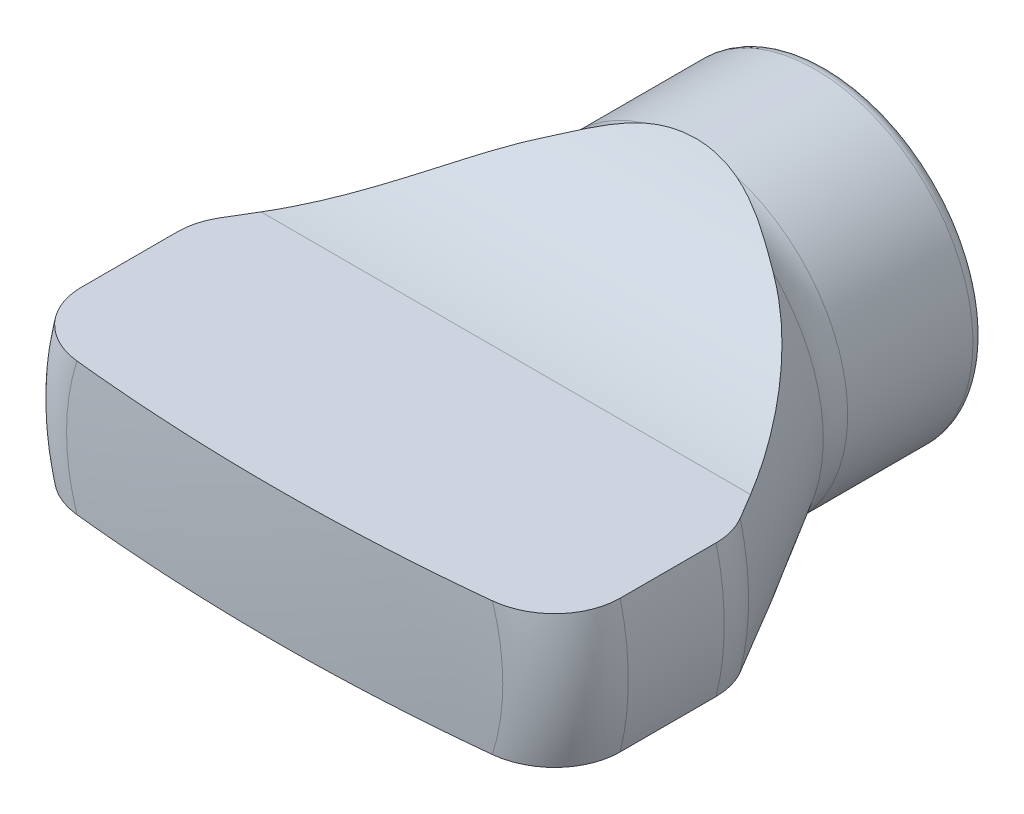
ISO-10303-21;
HEADER;
FILE_DESCRIPTION(('STEP AP214'),'2;1');
FILE_NAME('part.step','',(''),(''),'','','');
FILE_SCHEMA(('AUTOMOTIVE_DESIGN { 1 0 10303 214 1 1 1 1 }'));
ENDSEC;
DATA;
#1=APPLICATION_CONTEXT('core data for automotive mechanical design processes');
#2=APPLICATION_PROTOCOL_DEFINITION('international standard','automotive_design',2000,#1);
#3=PRODUCT_CONTEXT('',#1,'mechanical');
#4=PRODUCT('Part','Part','',(#3));
#5=PRODUCT_RELATED_PRODUCT_CATEGORY('part','',(#4));
#6=PRODUCT_DEFINITION_FORMATION('','',#4);
#7=PRODUCT_DEFINITION_CONTEXT('part definition',#1,'design');
#8=PRODUCT_DEFINITION('design','',#6,#7);
#9=PRODUCT_DEFINITION_SHAPE('','',#8);
#10=(LENGTH_UNIT() NAMED_UNIT(*) SI_UNIT(.MILLI.,.METRE.));
#11=(NAMED_UNIT(*) PLANE_ANGLE_UNIT() SI_UNIT($,.RADIAN.));
#12=(NAMED_UNIT(*) SI_UNIT($,.STERADIAN.) SOLID_ANGLE_UNIT());
#13=UNCERTAINTY_MEASURE_WITH_UNIT(LENGTH_MEASURE(1.E-05),#10,'distance_accuracy_value','');
#14=(GEOMETRIC_REPRESENTATION_CONTEXT(3) GLOBAL_UNCERTAINTY_ASSIGNED_CONTEXT((#13)) GLOBAL_UNIT_ASSIGNED_CONTEXT((#10,
#11,#12)) REPRESENTATION_CONTEXT('',''));
#15=CARTESIAN_POINT('',(0.,0.,0.));
#16=DIRECTION('',(0.,0.,1.));
#17=DIRECTION('',(1.,0.,0.));
#18=AXIS2_PLACEMENT_3D('',#15,#16,#17);
#19=CARTESIAN_POINT('',(0.,0.,-64.9999999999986));
#20=DIRECTION('',(0.,0.,-1.));
#21=DIRECTION('',(1.,0.,0.));
#22=AXIS2_PLACEMENT_3D('',#19,#20,#21);
#23=SPHERICAL_SURFACE('',#22,89.9999999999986);
#24=CARTESIAN_POINT('',(0.,0.,24.461827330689));
#25=DIRECTION('',(0.,0.,-1.));
#26=DIRECTION('',(0.,1.,0.));
#27=AXIS2_PLACEMENT_3D('',#24,#25,#26);
#28=CIRCLE('',#27,9.82758620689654);
#29=CARTESIAN_POINT('',(-9.35849617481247,-3.,24.461827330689));
#30=VERTEX_POINT('',#29);
#31=CARTESIAN_POINT('',(-9.35849617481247,3.,24.461827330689));
#32=VERTEX_POINT('',#31);
#33=EDGE_CURVE('E334',#30,#32,#28,.T.);
#34=ORIENTED_EDGE('',*,*,#33,.F.);
#35=CARTESIAN_POINT('',(0.,-3.,-64.9999999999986));
#36=DIRECTION('',(0.,-1.,0.));
#37=DIRECTION('',(1.,0.,0.));
#38=AXIS2_PLACEMENT_3D('',#35,#36,#37);
#39=CIRCLE('',#38,89.9499861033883);
#40=CARTESIAN_POINT('',(9.35849617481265,-3.,24.461827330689));
#41=VERTEX_POINT('',#40);
#42=EDGE_CURVE('E287',#30,#41,#39,.F.);
#43=ORIENTED_EDGE('',*,*,#42,.T.);
#44=CARTESIAN_POINT('',(9.35849617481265,3.,24.461827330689));
#45=VERTEX_POINT('',#44);
#46=EDGE_CURVE('E335',#45,#41,#28,.T.);
#47=ORIENTED_EDGE('',*,*,#46,.F.);
#48=CARTESIAN_POINT('',(0.,3.,-64.9999999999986));
#49=DIRECTION('',(0.,1.,0.));
#50=DIRECTION('',(-1.,0.,0.));
#51=AXIS2_PLACEMENT_3D('',#48,#49,#50);
#52=CIRCLE('',#51,89.9499861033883);
#53=EDGE_CURVE('E309',#45,#32,#52,.F.);
#54=ORIENTED_EDGE('',*,*,#53,.T.);
#55=EDGE_LOOP('',(#34,#43,#47,#54));
#56=FACE_BOUND('',#55,.T.);
#57=ADVANCED_FACE('F14',(#56),#23,.T.);
#58=CARTESIAN_POINT('',(0.,0.,21.479766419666));
#59=DIRECTION('',(0.,0.,-1.));
#60=DIRECTION('',(0.,1.,0.));
#61=AXIS2_PLACEMENT_3D('',#58,#59,#60);
#62=TOROIDAL_SURFACE('',#61,9.5,3.);
#63=CARTESIAN_POINT('',(0.,0.,21.479766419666));
#64=DIRECTION('',(0.,0.,-1.));
#65=DIRECTION('',(0.,1.,0.));
#66=AXIS2_PLACEMENT_3D('',#63,#64,#65);
#67=CIRCLE('',#66,12.5);
#68=CARTESIAN_POINT('',(-12.1346610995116,-3.,21.479766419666));
#69=VERTEX_POINT('',#68);
#70=CARTESIAN_POINT('',(-12.1346610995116,3.,21.479766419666));
#71=VERTEX_POINT('',#70);
#72=EDGE_CURVE('E331',#69,#71,#67,.T.);
#73=ORIENTED_EDGE('',*,*,#72,.F.);
#74=CARTESIAN_POINT('',(-11.7237759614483,-3.,22.9737759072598));
#75=CARTESIAN_POINT('',(-11.6368347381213,-3.,23.1204234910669));
#76=CARTESIAN_POINT('',(-11.5371404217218,-3.,23.2596903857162));
#77=CARTESIAN_POINT('',(-11.315494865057,-3.,23.5194421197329));
#78=CARTESIAN_POINT('',(-11.1935086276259,-3.,23.63989686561));
#79=CARTESIAN_POINT('',(-10.9314122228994,-3.,23.858559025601));
#80=CARTESIAN_POINT('',(-10.7913372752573,-3.,23.9568086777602));
#81=CARTESIAN_POINT('',(-10.4970909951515,-3.,24.1290589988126));
#82=CARTESIAN_POINT('',(-10.3429233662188,-3.,24.2030660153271));
#83=CARTESIAN_POINT('',(-10.0205079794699,-3.,24.3270766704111));
#84=CARTESIAN_POINT('',(-9.85199468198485,-3.,24.3763890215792));
#85=CARTESIAN_POINT('',(-9.50923380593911,-3.,24.4472793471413));
#86=CARTESIAN_POINT('',(-9.33498483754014,-3.,24.4688505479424));
#87=CARTESIAN_POINT('',(-8.97789494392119,-3.,24.4845747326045));
#88=CARTESIAN_POINT('',(-8.79500141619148,-3.,24.4775338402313));
#89=CARTESIAN_POINT('',(-8.43274799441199,-3.,24.4340125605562));
#90=CARTESIAN_POINT('',(-8.25338888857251,-3.,24.3975256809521));
#91=CARTESIAN_POINT('',(-7.89627744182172,-3.,24.294445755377));
#92=CARTESIAN_POINT('',(-7.71883309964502,-3.,24.2267832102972));
#93=CARTESIAN_POINT('',(-7.37760011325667,-3.,24.0628865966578));
#94=CARTESIAN_POINT('',(-7.2138147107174,-3.,23.9666457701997));
#95=CARTESIAN_POINT('',(-6.90360189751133,-3.,23.7469407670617));
#96=CARTESIAN_POINT('',(-6.75732706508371,-3.,23.6232608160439));
#97=CARTESIAN_POINT('',(-6.4889095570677,-3.,23.3517541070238));
#98=CARTESIAN_POINT('',(-6.3667622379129,-3.,23.203932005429));
#99=CARTESIAN_POINT('',(-6.20884449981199,-3.,22.9713467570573));
#100=CARTESIAN_POINT('',(-6.16142786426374,-3.,22.8942976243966));
#101=CARTESIAN_POINT('',(-6.07388663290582,-3.,22.7361794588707));
#102=CARTESIAN_POINT('',(-6.0337580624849,-3.,22.6551126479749));
#103=CARTESIAN_POINT('',(-5.96138485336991,-3.,22.4895902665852));
#104=CARTESIAN_POINT('',(-5.92913555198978,-3.,22.4051367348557));
#105=CARTESIAN_POINT('',(-5.87300865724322,-3.,22.2334905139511));
#106=CARTESIAN_POINT('',(-5.84913003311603,-3.,22.1462981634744));
#107=CARTESIAN_POINT('',(-5.81223458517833,-3.,21.9793283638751));
#108=CARTESIAN_POINT('',(-5.79833439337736,-3.,21.8997452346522));
#109=CARTESIAN_POINT('',(-5.77776594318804,-3.,21.7396194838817));
#110=CARTESIAN_POINT('',(-5.77110004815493,-3.,21.6590765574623));
#111=CARTESIAN_POINT('',(-5.76512077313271,-3.,21.4977738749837));
#112=CARTESIAN_POINT('',(-5.76580186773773,-3.,21.4170143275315));
#113=CARTESIAN_POINT('',(-5.77448254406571,-3.,21.2558809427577));
#114=CARTESIAN_POINT('',(-5.78248478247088,-3.,21.1755072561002));
#115=CARTESIAN_POINT('',(-5.8157343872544,-3.,20.9469387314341));
#116=CARTESIAN_POINT('',(-5.84989838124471,-3.,20.7999488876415));
#117=CARTESIAN_POINT('',(-5.94154886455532,-3.,20.5135512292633));
#118=CARTESIAN_POINT('',(-5.99903896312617,-3.,20.3741445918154));
#119=CARTESIAN_POINT('',(-6.13733979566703,-3.,20.1009705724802));
#120=CARTESIAN_POINT('',(-6.21893008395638,-3.,19.9675988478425));
#121=CARTESIAN_POINT('',(-6.40141213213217,-3.,19.7148233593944));
#122=CARTESIAN_POINT('',(-6.50231086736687,-3.,19.5954246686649));
#123=CARTESIAN_POINT('',(-6.73119663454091,-3.,19.3615097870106));
#124=CARTESIAN_POINT('',(-6.86087722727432,-3.,19.2486501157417));
#125=CARTESIAN_POINT('',(-7.13606730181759,-3.,19.0442370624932));
#126=CARTESIAN_POINT('',(-7.28158323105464,-3.,18.9526924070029));
#127=CARTESIAN_POINT('',(-7.59763163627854,-3.,18.7858480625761));
#128=CARTESIAN_POINT('',(-7.76923902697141,-3.,18.7125775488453));
#129=CARTESIAN_POINT('',(-8.12211390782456,-3.,18.5949559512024));
#130=CARTESIAN_POINT('',(-8.30338336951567,-3.,18.5506107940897));
#131=CARTESIAN_POINT('',(-8.67599551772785,-3.,18.4914412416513));
#132=CARTESIAN_POINT('',(-8.86747809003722,-3.,18.4774893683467));
#133=CARTESIAN_POINT('',(-9.25002035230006,-3.,18.482648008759));
#134=CARTESIAN_POINT('',(-9.44108007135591,-3.,18.5017561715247));
#135=CARTESIAN_POINT('',(-9.81297194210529,-3.,18.5724125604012));
#136=CARTESIAN_POINT('',(-9.99393463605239,-3.,18.6232708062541));
#137=CARTESIAN_POINT('',(-10.344133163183,-3.,18.7559809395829));
#138=CARTESIAN_POINT('',(-10.5133716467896,-3.,18.837825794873));
#139=CARTESIAN_POINT('',(-10.8276485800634,-3.,19.026500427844));
#140=CARTESIAN_POINT('',(-10.9734063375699,-3.,19.1321318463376));
#141=CARTESIAN_POINT('',(-11.2441341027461,-3.,19.3673359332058));
#142=CARTESIAN_POINT('',(-11.3691091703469,-3.,19.4969027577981));
#143=CARTESIAN_POINT('',(-11.5893099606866,-3.,19.770487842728));
#144=CARTESIAN_POINT('',(-11.6855491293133,-3.,19.9136908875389));
#145=CARTESIAN_POINT('',(-11.8517435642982,-3.,20.2146072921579));
#146=CARTESIAN_POINT('',(-11.9217049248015,-3.,20.3723172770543));
#147=CARTESIAN_POINT('',(-12.0312876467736,-3.,20.6926425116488));
#148=CARTESIAN_POINT('',(-12.0717577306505,-3.,20.8549678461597));
#149=CARTESIAN_POINT('',(-12.1244093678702,-3.,21.1841916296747));
#150=CARTESIAN_POINT('',(-12.1365859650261,-3.,21.3510908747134));
#151=CARTESIAN_POINT('',(-12.1322719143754,-3.,21.6820235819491));
#152=CARTESIAN_POINT('',(-12.1162017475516,-3.,21.8460629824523));
#153=CARTESIAN_POINT('',(-12.0567271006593,-3.,22.1689457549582));
#154=CARTESIAN_POINT('',(-12.0133604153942,-3.,22.3277959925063));
#155=CARTESIAN_POINT('',(-11.925917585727,-3.,22.5671796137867));
#156=CARTESIAN_POINT('',(-11.890762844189,-3.,22.6510787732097));
#157=CARTESIAN_POINT('',(-11.8128727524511,-3.,22.8152767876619));
#158=CARTESIAN_POINT('',(-11.7701375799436,-3.,22.8955757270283));
#159=CARTESIAN_POINT('',(-11.7237759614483,-3.,22.9737759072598));
#160=B_SPLINE_CURVE_WITH_KNOTS('',3,(#74,#75,#76,#77,#78,#79,#80,#81,#82,#83,#84,#85,#86,#87,
#88,#89,#90,#91,#92,#93,#94,#95,#96,#97,#98,#99,#100,#101,#102,#103,#104,#105,#106,#107,#108,
#109,#110,#111,#112,#113,#114,#115,#116,#117,#118,#119,#120,#121,#122,#123,#124,#125,#126,#127,
#128,#129,#130,#131,#132,#133,#134,#135,#136,#137,#138,#139,#140,#141,#142,#143,#144,#145,#146,
#147,#148,#149,#150,#151,#152,#153,#154,#155,#156,#157,#158,#159),.UNSPECIFIED.,.T.,.F.,(4,2,2,
2,2,2,2,2,2,2,2,2,2,2,2,2,2,2,2,2,2,2,2,2,2,2,2,2,2,2,2,2,2,2,2,2,2,2,2,2,2,2,4),(0.,
0.511102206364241,1.02301382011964,1.53394333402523,2.04473896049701,2.56912966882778,
3.09364839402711,3.64027333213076,4.18701882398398,4.75410408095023,5.3213235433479,
5.8931724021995,6.46491109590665,6.73601299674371,7.00696660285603,7.2777594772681,
7.5485189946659,7.79056318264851,8.03268641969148,8.27462757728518,8.51665656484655,
8.96712840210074,9.41766996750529,9.88477282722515,10.3520447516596,10.8656245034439,
11.3794141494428,11.936664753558,12.4940295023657,13.0671949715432,13.6403196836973,
14.2014033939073,14.7623598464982,15.2996748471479,15.8368588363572,16.3519133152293,
16.8668482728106,17.3663058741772,17.8658509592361,18.3580226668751,18.8495144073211,
19.1220672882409,19.3946137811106),.UNSPECIFIED.);
#161=EDGE_CURVE('E344',#69,#30,#160,.T.);
#162=ORIENTED_EDGE('',*,*,#161,.T.);
#163=ORIENTED_EDGE('',*,*,#33,.T.);
#164=CARTESIAN_POINT('',(-11.7237759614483,3.,22.9737759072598));
#165=CARTESIAN_POINT('',(-11.8077215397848,3.,22.8321504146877));
#166=CARTESIAN_POINT('',(-11.8799063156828,3.,22.6834265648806));
#167=CARTESIAN_POINT('',(-11.9983941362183,3.,22.3758725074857));
#168=CARTESIAN_POINT('',(-12.0446711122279,3.,22.217032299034));
#169=CARTESIAN_POINT('',(-12.1097847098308,3.,21.8938023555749));
#170=CARTESIAN_POINT('',(-12.1286211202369,3.,21.7294125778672));
#171=CARTESIAN_POINT('',(-12.1382275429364,3.,21.3998525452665));
#172=CARTESIAN_POINT('',(-12.1290037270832,3.,21.2346824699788));
#173=CARTESIAN_POINT('',(-12.0829469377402,3.,20.9092581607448));
#174=CARTESIAN_POINT('',(-12.0462801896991,3.,20.7489803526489));
#175=CARTESIAN_POINT('',(-11.9467009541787,3.,20.4368028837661));
#176=CARTESIAN_POINT('',(-11.8837876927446,3.,20.2849034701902));
#177=CARTESIAN_POINT('',(-11.7332642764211,3.,19.9928150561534));
#178=CARTESIAN_POINT('',(-11.6455181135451,3.,19.8526962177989));
#179=CARTESIAN_POINT('',(-11.4481782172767,3.,19.5888134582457));
#180=CARTESIAN_POINT('',(-11.338582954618,3.,19.4650506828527));
#181=CARTESIAN_POINT('',(-11.0984089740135,3.,19.2346565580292));
#182=CARTESIAN_POINT('',(-10.9674545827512,3.,19.1284171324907));
#183=CARTESIAN_POINT('',(-10.6900445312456,3.,18.9386227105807));
#184=CARTESIAN_POINT('',(-10.5435868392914,3.,18.8550706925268));
#185=CARTESIAN_POINT('',(-10.2342742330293,3.,18.7100368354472));
#186=CARTESIAN_POINT('',(-10.0710402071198,3.,18.6493641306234));
#187=CARTESIAN_POINT('',(-9.73694688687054,3.,18.5550869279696));
#188=CARTESIAN_POINT('',(-9.56608615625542,3.,18.5214875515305));
#189=CARTESIAN_POINT('',(-9.21411001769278,3.,18.4808401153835));
#190=CARTESIAN_POINT('',(-9.03286193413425,3.,18.474941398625));
#191=CARTESIAN_POINT('',(-8.67178419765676,3.,18.4924147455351));
#192=CARTESIAN_POINT('',(-8.49195486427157,3.,18.5157932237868));
#193=CARTESIAN_POINT('',(-8.13124489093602,3.,18.5923462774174));
#194=CARTESIAN_POINT('',(-7.95060761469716,3.,18.6466704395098));
#195=CARTESIAN_POINT('',(-7.6007052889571,3.,18.7843247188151));
#196=CARTESIAN_POINT('',(-7.43144297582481,3.,18.8676617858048));
#197=CARTESIAN_POINT('',(-7.1063043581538,3.,19.0630486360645));
#198=CARTESIAN_POINT('',(-6.95071102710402,3.,19.1755711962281));
#199=CARTESIAN_POINT('',(-6.6614696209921,3.,19.426033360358));
#200=CARTESIAN_POINT('',(-6.52782134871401,3.,19.5639727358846));
#201=CARTESIAN_POINT('',(-6.29243660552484,3.,19.8565895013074));
#202=CARTESIAN_POINT('',(-6.18969006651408,3.,20.0104436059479));
#203=CARTESIAN_POINT('',(-6.05859007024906,3.,20.2533915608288));
#204=CARTESIAN_POINT('',(-6.01871945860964,3.,20.3364247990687));
#205=CARTESIAN_POINT('',(-5.94721129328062,3.,20.5059457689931));
#206=CARTESIAN_POINT('',(-5.91556885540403,3.,20.5924314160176));
#207=CARTESIAN_POINT('',(-5.86375500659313,3.,20.7593965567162));
#208=CARTESIAN_POINT('',(-5.84275705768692,3.,20.8396207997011));
#209=CARTESIAN_POINT('',(-5.80819130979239,3.,21.0016177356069));
#210=CARTESIAN_POINT('',(-5.79461968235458,3.,21.0833896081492));
#211=CARTESIAN_POINT('',(-5.77511768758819,3.,21.2478207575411));
#212=CARTESIAN_POINT('',(-5.76918495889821,3.,21.3304797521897));
#213=CARTESIAN_POINT('',(-5.76504164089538,3.,21.4959660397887));
#214=CARTESIAN_POINT('',(-5.76683064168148,3.,21.5787933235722));
#215=CARTESIAN_POINT('',(-5.78281130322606,3.,21.8122865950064));
#216=CARTESIAN_POINT('',(-5.80603339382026,3.,21.9624293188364));
#217=CARTESIAN_POINT('',(-5.87703382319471,3.,22.2566737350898));
#218=CARTESIAN_POINT('',(-5.92481436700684,3.,22.4007748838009));
#219=CARTESIAN_POINT('',(-6.04346486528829,3.,22.6814797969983));
#220=CARTESIAN_POINT('',(-6.11464880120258,3.,22.8179503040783));
#221=CARTESIAN_POINT('',(-6.27704022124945,3.,23.0783675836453));
#222=CARTESIAN_POINT('',(-6.36825410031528,3.,23.2023103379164));
#223=CARTESIAN_POINT('',(-6.5769924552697,3.,23.4463341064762));
#224=CARTESIAN_POINT('',(-6.69616877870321,3.,23.5650014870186));
#225=CARTESIAN_POINT('',(-6.95124002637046,3.,23.7827476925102));
#226=CARTESIAN_POINT('',(-7.08714204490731,3.,23.8818181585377));
#227=CARTESIAN_POINT('',(-7.38547927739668,3.,24.0668749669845));
#228=CARTESIAN_POINT('',(-7.54920681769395,3.,24.1507836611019));
#229=CARTESIAN_POINT('',(-7.88803145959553,3.,24.2912125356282));
#230=CARTESIAN_POINT('',(-8.06313154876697,3.,24.3477254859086));
#231=CARTESIAN_POINT('',(-8.42762134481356,3.,24.4335588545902));
#232=CARTESIAN_POINT('',(-8.61730247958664,3.,24.461650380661));
#233=CARTESIAN_POINT('',(-8.99869568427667,3.,24.485178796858));
#234=CARTESIAN_POINT('',(-9.19040764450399,3.,24.4806174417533));
#235=CARTESIAN_POINT('',(-9.56779063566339,3.,24.4385959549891));
#236=CARTESIAN_POINT('',(-9.75350725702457,3.,24.401548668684));
#237=CARTESIAN_POINT('',(-10.1156519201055,3.,24.2954781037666));
#238=CARTESIAN_POINT('',(-10.2920794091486,3.,24.2264529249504));
#239=CARTESIAN_POINT('',(-10.6230709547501,3.,24.0612417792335));
#240=CARTESIAN_POINT('',(-10.7782219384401,3.,23.9662305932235));
#241=CARTESIAN_POINT('',(-11.0692594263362,3.,23.7504802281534));
#242=CARTESIAN_POINT('',(-11.2051757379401,3.,23.6297815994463));
#243=CARTESIAN_POINT('',(-11.404236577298,3.,23.4181818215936));
#244=CARTESIAN_POINT('',(-11.4749541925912,3.,23.3342770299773));
#245=CARTESIAN_POINT('',(-11.6067775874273,3.,23.1592222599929));
#246=CARTESIAN_POINT('',(-11.6678836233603,3.,23.0680724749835));
#247=CARTESIAN_POINT('',(-11.7237759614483,3.,22.9737759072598));
#248=B_SPLINE_CURVE_WITH_KNOTS('',3,(#164,#165,#166,#167,#168,#169,#170,#171,#172,#173,#174,
#175,#176,#177,#178,#179,#180,#181,#182,#183,#184,#185,#186,#187,#188,#189,#190,#191,#192,#193,
#194,#195,#196,#197,#198,#199,#200,#201,#202,#203,#204,#205,#206,#207,#208,#209,#210,#211,#212,
#213,#214,#215,#216,#217,#218,#219,#220,#221,#222,#223,#224,#225,#226,#227,#228,#229,#230,#231,
#232,#233,#234,#235,#236,#237,#238,#239,#240,#241,#242,#243,#244,#245,#246,#247),.UNSPECIFIED.,
.T.,.F.,(4,2,2,2,2,2,2,2,2,2,2,2,2,2,2,2,2,2,2,2,2,2,2,2,2,2,2,2,2,2,2,2,2,2,2,2,2,2,2,2,2,4),
(0.,0.493510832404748,0.987517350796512,1.48152767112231,1.97542934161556,2.4663633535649,
2.95731184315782,3.45100306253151,3.9447288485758,4.44832446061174,4.95198615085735,
5.47208277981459,5.99227777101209,6.53387633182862,7.07559357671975,7.6388854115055,
8.20231227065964,8.77550798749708,9.34869855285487,9.90035993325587,10.1763317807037,
10.4521394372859,10.7005872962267,10.9489069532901,11.1971498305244,11.4453795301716,
11.8988158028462,12.3522927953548,12.8121204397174,13.2720951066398,13.7745476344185,
14.2772140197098,14.8266915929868,15.3763141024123,15.948798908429,16.5212529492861,
17.086535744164,17.6518521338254,18.1949385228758,18.7371738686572,19.0657702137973,
19.3943577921),.UNSPECIFIED.);
#249=EDGE_CURVE('E303',#32,#71,#248,.T.);
#250=ORIENTED_EDGE('',*,*,#249,.T.);
#251=EDGE_LOOP('',(#73,#162,#163,#250));
#252=FACE_BOUND('',#251,.T.);
#253=ADVANCED_FACE('F289',(#252),#62,.T.);
#254=CARTESIAN_POINT('',(12.1346610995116,3.,21.479766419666));
#255=VERTEX_POINT('',#254);
#256=CARTESIAN_POINT('',(12.1346610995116,-3.,21.479766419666));
#257=VERTEX_POINT('',#256);
#258=EDGE_CURVE('E332',#255,#257,#67,.T.);
#259=ORIENTED_EDGE('',*,*,#258,.F.);
#260=CARTESIAN_POINT('',(6.04374007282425,3.,22.6726382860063));
#261=CARTESIAN_POINT('',(5.97702609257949,3.,22.534735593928));
#262=CARTESIAN_POINT('',(5.92127288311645,3.,22.3914729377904));
#263=CARTESIAN_POINT('',(5.83430220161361,3.,22.0976296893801));
#264=CARTESIAN_POINT('',(5.80308540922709,3.,21.9470488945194));
#265=CARTESIAN_POINT('',(5.76684993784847,3.,21.642473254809));
#266=CARTESIAN_POINT('',(5.76187630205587,3.,21.4884729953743));
#267=CARTESIAN_POINT('',(5.77854271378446,3.,21.1819360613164));
#268=CARTESIAN_POINT('',(5.80018200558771,3.,21.0293993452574));
#269=CARTESIAN_POINT('',(5.8681152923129,3.,20.7333774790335));
#270=CARTESIAN_POINT('',(5.91387805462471,3.,20.5897691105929));
#271=CARTESIAN_POINT('',(6.02754093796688,3.,20.3116281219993));
#272=CARTESIAN_POINT('',(6.09544665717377,3.,20.1770978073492));
#273=CARTESIAN_POINT('',(6.25529394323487,3.,19.9122646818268));
#274=CARTESIAN_POINT('',(6.34841373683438,3.,19.7826752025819));
#275=CARTESIAN_POINT('',(6.55319457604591,3.,19.5391085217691));
#276=CARTESIAN_POINT('',(6.66486281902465,3.,19.4251374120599));
#277=CARTESIAN_POINT('',(6.91578388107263,3.,19.2039247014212));
#278=CARTESIAN_POINT('',(7.05668842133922,3.,19.0985545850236));
#279=CARTESIAN_POINT('',(7.35319204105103,3.,18.9110349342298));
#280=CARTESIAN_POINT('',(7.508796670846,3.,18.8288942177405));
#281=CARTESIAN_POINT('',(7.84256388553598,3.,18.6844445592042));
#282=CARTESIAN_POINT('',(8.02154400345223,3.,18.6240166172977));
#283=CARTESIAN_POINT('',(8.38704994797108,3.,18.5335601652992));
#284=CARTESIAN_POINT('',(8.5735767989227,3.,18.503535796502));
#285=CARTESIAN_POINT('',(8.95176937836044,3.,18.4749094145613));
#286=CARTESIAN_POINT('',(9.14347043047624,3.,18.4767658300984));
#287=CARTESIAN_POINT('',(9.52368184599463,3.,18.513623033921));
#288=CARTESIAN_POINT('',(9.71219259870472,3.,18.5486197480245));
#289=CARTESIAN_POINT('',(10.0747826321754,3.,18.6499384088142));
#290=CARTESIAN_POINT('',(10.2491209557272,3.,18.7153312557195));
#291=CARTESIAN_POINT('',(10.5835935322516,3.,18.8757639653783));
#292=CARTESIAN_POINT('',(10.7437312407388,3.,18.9707965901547));
#293=CARTESIAN_POINT('',(11.0378069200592,3.,19.1833514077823));
#294=CARTESIAN_POINT('',(11.1725809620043,3.,19.2997169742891));
#295=CARTESIAN_POINT('',(11.4196825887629,3.,19.5542490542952));
#296=CARTESIAN_POINT('',(11.5320154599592,3.,19.6924104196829));
#297=CARTESIAN_POINT('',(11.7264684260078,3.,19.9807350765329));
#298=CARTESIAN_POINT('',(11.8095978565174,3.,20.130218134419));
#299=CARTESIAN_POINT('',(11.9487889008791,3.,20.4412963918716));
#300=CARTESIAN_POINT('',(12.004855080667,3.,20.6028895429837));
#301=CARTESIAN_POINT('',(12.0869123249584,3.,20.9289638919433));
#302=CARTESIAN_POINT('',(12.1136627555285,3.,21.0932543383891));
#303=CARTESIAN_POINT('',(12.1388436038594,3.,21.4239867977));
#304=CARTESIAN_POINT('',(12.1372765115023,3.,21.5904286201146));
#305=CARTESIAN_POINT('',(12.1060619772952,3.,21.9186944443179));
#306=CARTESIAN_POINT('',(12.076740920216,3.,22.0805496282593));
#307=CARTESIAN_POINT('',(11.991432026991,3.,22.3970632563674));
#308=CARTESIAN_POINT('',(11.9354444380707,3.,22.5517217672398));
#309=CARTESIAN_POINT('',(11.7983216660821,3.,22.85011377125));
#310=CARTESIAN_POINT('',(11.717097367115,3.,22.9938062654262));
#311=CARTESIAN_POINT('',(11.5320823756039,3.,23.2658272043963));
#312=CARTESIAN_POINT('',(11.4282903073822,3.,23.3941547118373));
#313=CARTESIAN_POINT('',(11.1991773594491,3.,23.6343792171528));
#314=CARTESIAN_POINT('',(11.0735005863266,3.,23.7459365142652));
#315=CARTESIAN_POINT('',(10.8056878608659,3.,23.9471158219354));
#316=CARTESIAN_POINT('',(10.6635498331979,3.,24.0367350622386));
#317=CARTESIAN_POINT('',(10.3621869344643,3.,24.1945486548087));
#318=CARTESIAN_POINT('',(10.2025682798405,3.,24.2619904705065));
#319=CARTESIAN_POINT('',(9.87456382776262,3.,24.3702766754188));
#320=CARTESIAN_POINT('',(9.70617642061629,3.,24.4111161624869));
#321=CARTESIAN_POINT('',(9.3581769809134,3.,24.4668105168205));
#322=CARTESIAN_POINT('',(9.17838633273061,3.,24.4805486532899));
#323=CARTESIAN_POINT('',(8.81894839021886,3.,24.4789147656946));
#324=CARTESIAN_POINT('',(8.63930112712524,3.,24.4635375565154));
#325=CARTESIAN_POINT('',(8.27746929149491,3.,24.4032841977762));
#326=CARTESIAN_POINT('',(8.09548055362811,3.,24.3572293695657));
#327=CARTESIAN_POINT('',(7.74143216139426,3.,24.2359018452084));
#328=CARTESIAN_POINT('',(7.56937730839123,3.,24.1606151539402));
#329=CARTESIAN_POINT('',(7.23628162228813,3.,23.9806837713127));
#330=CARTESIAN_POINT('',(7.0755781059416,3.,23.8754133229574));
#331=CARTESIAN_POINT('',(6.77484148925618,3.,23.6387361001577));
#332=CARTESIAN_POINT('',(6.63478585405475,3.,23.5073581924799));
#333=CARTESIAN_POINT('',(6.41516827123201,3.,23.2603781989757));
#334=CARTESIAN_POINT('',(6.32950057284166,3.,23.1501573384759));
#335=CARTESIAN_POINT('',(6.17411840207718,3.,22.9189783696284));
#336=CARTESIAN_POINT('',(6.10439858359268,3.,22.7980238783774));
#337=CARTESIAN_POINT('',(6.04374007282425,3.,22.6726382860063));
#338=B_SPLINE_CURVE_WITH_KNOTS('',3,(#260,#261,#262,#263,#264,#265,#266,#267,#268,#269,#270,
#271,#272,#273,#274,#275,#276,#277,#278,#279,#280,#281,#282,#283,#284,#285,#286,#287,#288,#289,
#290,#291,#292,#293,#294,#295,#296,#297,#298,#299,#300,#301,#302,#303,#304,#305,#306,#307,#308,
#309,#310,#311,#312,#313,#314,#315,#316,#317,#318,#319,#320,#321,#322,#323,#324,#325,#326,#327,
#328,#329,#330,#331,#332,#333,#334,#335,#336,#337),.UNSPECIFIED.,.T.,.F.,(4,2,2,2,2,2,2,2,2,2,2,
2,2,2,2,2,2,2,2,2,2,2,2,2,2,2,2,2,2,2,2,2,2,2,2,2,2,2,4),(0.,0.459126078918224,0.91826487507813,
1.37819147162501,1.83810500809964,2.28828946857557,2.73858783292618,3.21535529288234,
3.69230818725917,4.2178994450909,4.74368995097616,5.30778966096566,5.87196619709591,
6.44426199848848,7.01648745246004,7.5722687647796,8.12791446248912,8.65941659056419,
9.19079336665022,9.70139946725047,10.2119193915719,10.7088776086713,11.2057921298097,
11.6969346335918,12.1880725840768,12.6809649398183,13.1738873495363,13.675737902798,
14.1776517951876,14.695166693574,15.2127769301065,15.7513038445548,16.2899266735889,
16.8505390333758,17.4114201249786,17.9849926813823,18.5579345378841,18.9755270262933,
19.3929793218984),.UNSPECIFIED.);
#339=EDGE_CURVE('E296',#255,#45,#338,.T.);
#340=ORIENTED_EDGE('',*,*,#339,.T.);
#341=ORIENTED_EDGE('',*,*,#46,.T.);
#342=CARTESIAN_POINT('',(6.04374007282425,-3.,22.6726382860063));
#343=CARTESIAN_POINT('',(6.1201842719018,-3.,22.8306235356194));
#344=CARTESIAN_POINT('',(6.21114510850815,-3.,22.981811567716));
#345=CARTESIAN_POINT('',(6.41770692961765,-3.,23.2665895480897));
#346=CARTESIAN_POINT('',(6.53337133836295,-3.,23.4001327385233));
#347=CARTESIAN_POINT('',(6.7843299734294,-3.,23.6460325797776));
#348=CARTESIAN_POINT('',(6.91953578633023,-3.,23.7584796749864));
#349=CARTESIAN_POINT('',(7.20579569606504,-3.,23.9607066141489));
#350=CARTESIAN_POINT('',(7.3568426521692,-3.,24.0504966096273));
#351=CARTESIAN_POINT('',(7.68130525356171,-3.,24.2108456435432));
#352=CARTESIAN_POINT('',(7.8555384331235,-3.,24.2797548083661));
#353=CARTESIAN_POINT('',(8.21297516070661,-3.,24.3881530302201));
#354=CARTESIAN_POINT('',(8.39618139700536,-3.,24.4276332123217));
#355=CARTESIAN_POINT('',(8.77105700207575,-3.,24.4763660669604));
#356=CARTESIAN_POINT('',(8.96282400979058,-3.,24.4848759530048));
#357=CARTESIAN_POINT('',(9.34498203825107,-3.,24.4687611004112));
#358=CARTESIAN_POINT('',(9.53537319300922,-3.,24.4441396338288));
#359=CARTESIAN_POINT('',(9.90442228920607,-3.,24.3627753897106));
#360=CARTESIAN_POINT('',(10.0832518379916,-3.,24.3068135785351));
#361=CARTESIAN_POINT('',(10.428308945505,-3.,24.1643307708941));
#362=CARTESIAN_POINT('',(10.5945395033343,-3.,24.0778170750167));
#363=CARTESIAN_POINT('',(10.9020540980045,-3.,23.880654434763));
#364=CARTESIAN_POINT('',(11.0441006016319,-3.,23.7711947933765));
#365=CARTESIAN_POINT('',(11.3068084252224,-3.,23.5290606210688));
#366=CARTESIAN_POINT('',(11.427474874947,-3.,23.3963916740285));
#367=CARTESIAN_POINT('',(11.6388674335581,-3.,23.1174604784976));
#368=CARTESIAN_POINT('',(11.7306089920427,-3.,22.9719673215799));
#369=CARTESIAN_POINT('',(11.8875179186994,-3.,22.6672935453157));
#370=CARTESIAN_POINT('',(11.9526901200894,-3.,22.5081154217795));
#371=CARTESIAN_POINT('',(12.052776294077,-3.,22.1855487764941));
#372=CARTESIAN_POINT('',(12.0885074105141,-3.,22.0224134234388));
#373=CARTESIAN_POINT('',(12.1316420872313,-3.,21.6924434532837));
#374=CARTESIAN_POINT('',(12.1390484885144,-3.,21.5256092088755));
#375=CARTESIAN_POINT('',(12.1253910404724,-3.,21.1954659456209));
#376=CARTESIAN_POINT('',(12.1047249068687,-3.,21.0321402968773));
#377=CARTESIAN_POINT('',(12.036291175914,-3.,20.7112778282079));
#378=CARTESIAN_POINT('',(11.9885241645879,-3.,20.5537408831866));
#379=CARTESIAN_POINT('',(11.8673330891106,-3.,20.2486597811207));
#380=CARTESIAN_POINT('',(11.7938782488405,-3.,20.1011278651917));
#381=CARTESIAN_POINT('',(11.6236111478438,-3.,19.8202367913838));
#382=CARTESIAN_POINT('',(11.5267976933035,-3.,19.6868783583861));
#383=CARTESIAN_POINT('',(11.3110245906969,-3.,19.4357637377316));
#384=CARTESIAN_POINT('',(11.1917374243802,-3.,19.3182892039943));
#385=CARTESIAN_POINT('',(10.9356252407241,-3.,19.1043591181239));
#386=CARTESIAN_POINT('',(10.7987982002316,-3.,19.007905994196));
#387=CARTESIAN_POINT('',(10.5072845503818,-3.,18.8356635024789));
#388=CARTESIAN_POINT('',(10.3521930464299,-3.,18.7605599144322));
#389=CARTESIAN_POINT('',(10.0319413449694,-3.,18.6363524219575));
#390=CARTESIAN_POINT('',(9.8667794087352,-3.,18.5872530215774));
#391=CARTESIAN_POINT('',(9.52417023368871,-3.,18.5143595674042));
#392=CARTESIAN_POINT('',(9.34649528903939,-3.,18.491636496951));
#393=CARTESIAN_POINT('',(8.98981012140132,-3.,18.4750550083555));
#394=CARTESIAN_POINT('',(8.81079962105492,-3.,18.4812027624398));
#395=CARTESIAN_POINT('',(8.4485839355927,-3.,18.5225870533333));
#396=CARTESIAN_POINT('',(8.26551601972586,-3.,18.5590283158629));
#397=CARTESIAN_POINT('',(7.90775291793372,-3.,18.6612772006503));
#398=CARTESIAN_POINT('',(7.73305969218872,-3.,18.7270916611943));
#399=CARTESIAN_POINT('',(7.39219513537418,-3.,18.8885420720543));
#400=CARTESIAN_POINT('',(7.22638086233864,-3.,18.9849346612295));
#401=CARTESIAN_POINT('',(6.9135951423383,-3.,19.2046286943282));
#402=CARTESIAN_POINT('',(6.7666266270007,-3.,19.3279343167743));
#403=CARTESIAN_POINT('',(6.4992245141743,-3.,19.5963634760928));
#404=CARTESIAN_POINT('',(6.37835585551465,-3.,19.741048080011));
#405=CARTESIAN_POINT('',(6.21864013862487,-3.,19.9727009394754));
#406=CARTESIAN_POINT('',(6.16898645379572,-3.,20.0523853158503));
#407=CARTESIAN_POINT('',(6.07750583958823,-3.,20.2161080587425));
#408=CARTESIAN_POINT('',(6.03567434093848,-3.,20.3001438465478));
#409=CARTESIAN_POINT('',(5.96367052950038,-3.,20.4646191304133));
#410=CARTESIAN_POINT('',(5.93280981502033,-3.,20.5447580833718));
#411=CARTESIAN_POINT('',(5.87863033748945,-3.,20.7075071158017));
#412=CARTESIAN_POINT('',(5.85530754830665,-3.,20.7901158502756));
#413=CARTESIAN_POINT('',(5.81656236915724,-3.,20.9571601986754));
#414=CARTESIAN_POINT('',(5.80113860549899,-3.,21.0415954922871));
#415=CARTESIAN_POINT('',(5.77844324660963,-3.,21.2115266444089));
#416=CARTESIAN_POINT('',(5.77117075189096,-3.,21.2970223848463));
#417=CARTESIAN_POINT('',(5.76244812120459,-3.,21.5366352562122));
#418=CARTESIAN_POINT('',(5.77024571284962,-3.,21.691183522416));
#419=CARTESIAN_POINT('',(5.81226815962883,-3.,21.9963826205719));
#420=CARTESIAN_POINT('',(5.84645399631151,-3.,22.1470388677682));
#421=CARTESIAN_POINT('',(5.9133473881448,-3.,22.358569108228));
#422=CARTESIAN_POINT('',(5.93626082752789,-3.,22.4226865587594));
#423=CARTESIAN_POINT('',(5.98663595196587,-3.,22.5490891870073));
#424=CARTESIAN_POINT('',(6.01409655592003,-3.,22.6113747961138));
#425=CARTESIAN_POINT('',(6.04374007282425,-3.,22.6726382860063));
#426=B_SPLINE_CURVE_WITH_KNOTS('',3,(#342,#343,#344,#345,#346,#347,#348,#349,#350,#351,#352,
#353,#354,#355,#356,#357,#358,#359,#360,#361,#362,#363,#364,#365,#366,#367,#368,#369,#370,#371,
#372,#373,#374,#375,#376,#377,#378,#379,#380,#381,#382,#383,#384,#385,#386,#387,#388,#389,#390,
#391,#392,#393,#394,#395,#396,#397,#398,#399,#400,#401,#402,#403,#404,#405,#406,#407,#408,#409,
#410,#411,#412,#413,#414,#415,#416,#417,#418,#419,#420,#421,#422,#423,#424,#425),.UNSPECIFIED.,
.T.,.F.,(4,2,2,2,2,2,2,2,2,2,2,2,2,2,2,2,2,2,2,2,2,2,2,2,2,2,2,2,2,2,2,2,2,2,2,2,2,2,2,2,2,4),
(0.,0.526250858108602,1.05386941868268,1.57917149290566,2.10423778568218,2.66378100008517,
3.22349288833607,3.7965435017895,4.36953752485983,4.92885070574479,5.48803032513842,
6.02331544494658,6.55847195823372,7.07193369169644,7.58530197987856,8.08388984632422,
8.58242770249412,9.07397572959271,9.56551312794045,10.0576414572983,10.5497949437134,
11.0497702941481,11.5498033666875,12.0644404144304,12.5791665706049,13.1141329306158,
13.6492136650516,14.2066524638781,14.764221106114,15.3368321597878,15.9095321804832,
16.4717872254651,16.7531029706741,17.0342538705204,17.2915314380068,17.5486713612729,
17.805766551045,18.0628333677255,18.5246016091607,18.9856883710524,19.1898062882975,
19.3938757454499),.UNSPECIFIED.);
#427=EDGE_CURVE('E281',#41,#257,#426,.T.);
#428=ORIENTED_EDGE('',*,*,#427,.T.);
#429=EDGE_LOOP('',(#259,#340,#341,#428));
#430=FACE_BOUND('',#429,.T.);
#431=ADVANCED_FACE('F292',(#430),#62,.T.);
#432=CARTESIAN_POINT('',(0.,0.,0.));
#433=DIRECTION('',(0.,0.,-1.));
#434=DIRECTION('',(0.,1.,0.));
#435=AXIS2_PLACEMENT_3D('',#432,#433,#434);
#436=CYLINDRICAL_SURFACE('',#435,12.5);
#437=DIRECTION('',(0.,0.,-1.));
#438=VECTOR('',#437,1.);
#439=CARTESIAN_POINT('',(-12.1346610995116,-3.,0.));
#440=LINE('',#439,#438);
#441=CARTESIAN_POINT('',(-12.1346610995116,-3.,17.1569219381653));
#442=VERTEX_POINT('',#441);
#443=EDGE_CURVE('E389',#69,#442,#440,.T.);
#444=ORIENTED_EDGE('',*,*,#443,.F.);
#445=ORIENTED_EDGE('',*,*,#72,.T.);
#446=DIRECTION('',(0.,0.,-1.));
#447=VECTOR('',#446,1.);
#448=CARTESIAN_POINT('',(-12.1346610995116,3.,0.));
#449=LINE('',#448,#447);
#450=CARTESIAN_POINT('',(-12.1346610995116,3.,17.1569219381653));
#451=VERTEX_POINT('',#450);
#452=EDGE_CURVE('E308',#451,#71,#449,.F.);
#453=ORIENTED_EDGE('',*,*,#452,.F.);
#454=CARTESIAN_POINT('',(0.,0.,17.1569219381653));
#455=DIRECTION('',(0.,0.,-1.));
#456=DIRECTION('',(0.,1.,0.));
#457=AXIS2_PLACEMENT_3D('',#454,#455,#456);
#458=CIRCLE('',#457,12.5);
#459=EDGE_CURVE('E318',#442,#451,#458,.T.);
#460=ORIENTED_EDGE('',*,*,#459,.F.);
#461=EDGE_LOOP('',(#444,#445,#453,#460));
#462=FACE_BOUND('',#461,.T.);
#463=ADVANCED_FACE('F261',(#462),#436,.T.);
#464=DIRECTION('',(0.,0.,-1.));
#465=VECTOR('',#464,1.);
#466=CARTESIAN_POINT('',(12.1346610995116,3.,0.));
#467=LINE('',#466,#465);
#468=CARTESIAN_POINT('',(12.1346610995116,3.,17.1569219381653));
#469=VERTEX_POINT('',#468);
#470=EDGE_CURVE('E252',#255,#469,#467,.T.);
#471=ORIENTED_EDGE('',*,*,#470,.F.);
#472=ORIENTED_EDGE('',*,*,#258,.T.);
#473=DIRECTION('',(0.,0.,-1.));
#474=VECTOR('',#473,1.);
#475=CARTESIAN_POINT('',(12.1346610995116,-3.,0.));
#476=LINE('',#475,#474);
#477=CARTESIAN_POINT('',(12.1346610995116,-3.,17.1569219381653));
#478=VERTEX_POINT('',#477);
#479=EDGE_CURVE('E279',#478,#257,#476,.F.);
#480=ORIENTED_EDGE('',*,*,#479,.F.);
#481=EDGE_CURVE('E328',#469,#478,#458,.T.);
#482=ORIENTED_EDGE('',*,*,#481,.F.);
#483=EDGE_LOOP('',(#471,#472,#480,#482));
#484=FACE_BOUND('',#483,.T.);
#485=ADVANCED_FACE('F259',(#484),#436,.T.);
#486=CARTESIAN_POINT('',(0.,0.,17.1569219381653));
#487=DIRECTION('',(0.,0.,-1.));
#488=DIRECTION('',(0.,1.,0.));
#489=AXIS2_PLACEMENT_3D('',#486,#487,#488);
#490=TOROIDAL_SURFACE('',#489,9.5,3.);
#491=CARTESIAN_POINT('',(0.,0.,15.6569219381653));
#492=DIRECTION('',(0.,0.,-1.));
#493=DIRECTION('',(0.,1.,0.));
#494=AXIS2_PLACEMENT_3D('',#491,#492,#493);
#495=CIRCLE('',#494,12.0980762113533);
#496=CARTESIAN_POINT('',(-11.7202153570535,-3.,15.6569219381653));
#497=VERTEX_POINT('',#496);
#498=CARTESIAN_POINT('',(-11.7202153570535,3.,15.6569219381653));
#499=VERTEX_POINT('',#498);
#500=EDGE_CURVE('E316',#497,#499,#495,.T.);
#501=ORIENTED_EDGE('',*,*,#500,.F.);
#502=CARTESIAN_POINT('',(-12.0118046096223,-3.,16.3195642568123));
#503=CARTESIAN_POINT('',(-12.0588235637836,-3.,16.4765292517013));
#504=CARTESIAN_POINT('',(-12.0926692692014,-3.,16.637564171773));
#505=CARTESIAN_POINT('',(-12.1328414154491,-3.,16.963161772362));
#506=CARTESIAN_POINT('',(-12.139136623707,-3.,17.127728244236));
#507=CARTESIAN_POINT('',(-12.1239523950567,-3.,17.4555129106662));
#508=CARTESIAN_POINT('',(-12.102485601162,-3.,17.618731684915));
#509=CARTESIAN_POINT('',(-12.0324907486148,-3.,17.9392091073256));
#510=CARTESIAN_POINT('',(-11.9839687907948,-3.,18.0964690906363));
#511=CARTESIAN_POINT('',(-11.8613136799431,-3.,18.4009380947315));
#512=CARTESIAN_POINT('',(-11.7871404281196,-3.,18.5481309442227));
#513=CARTESIAN_POINT('',(-11.6155048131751,-3.,18.8282371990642));
#514=CARTESIAN_POINT('',(-11.5180405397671,-3.,18.9611494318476));
#515=CARTESIAN_POINT('',(-11.301022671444,-3.,19.2112928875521));
#516=CARTESIAN_POINT('',(-11.1811390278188,-3.,19.3282375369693));
#517=CARTESIAN_POINT('',(-10.9239311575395,-3.,19.5410217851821));
#518=CARTESIAN_POINT('',(-10.7866049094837,-3.,19.6368589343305));
#519=CARTESIAN_POINT('',(-10.4941621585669,-3.,19.8077994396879));
#520=CARTESIAN_POINT('',(-10.3386414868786,-3.,19.8822108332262));
#521=CARTESIAN_POINT('',(-10.0176499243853,-3.,20.0049766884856));
#522=CARTESIAN_POINT('',(-9.85217733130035,-3.,20.0533266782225));
#523=CARTESIAN_POINT('',(-9.50904178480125,-3.,20.1246582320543));
#524=CARTESIAN_POINT('',(-9.33115542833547,-3.,20.1465643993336));
#525=CARTESIAN_POINT('',(-8.97418101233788,-3.,20.1614873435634));
#526=CARTESIAN_POINT('',(-8.79509270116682,-3.,20.1544978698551));
#527=CARTESIAN_POINT('',(-8.43286657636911,-3.,20.1113888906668));
#528=CARTESIAN_POINT('',(-8.24987157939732,-3.,20.074066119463));
#529=CARTESIAN_POINT('',(-7.89240122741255,-3.,19.9700661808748));
#530=CARTESIAN_POINT('',(-7.71792785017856,-3.,19.9033822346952));
#531=CARTESIAN_POINT('',(-7.37773041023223,-3.,19.7402282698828));
#532=CARTESIAN_POINT('',(-7.21236202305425,-3.,19.6430138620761));
#533=CARTESIAN_POINT('',(-6.90062252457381,-3.,19.4217400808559));
#534=CARTESIAN_POINT('',(-6.7542542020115,-3.,19.2976767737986));
#535=CARTESIAN_POINT('',(-6.48833072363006,-3.,19.0279548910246));
#536=CARTESIAN_POINT('',(-6.36831546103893,-3.,18.8827557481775));
#537=CARTESIAN_POINT('',(-6.20995866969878,-3.,18.6504403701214));
#538=CARTESIAN_POINT('',(-6.16077048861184,-3.,18.5705515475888));
#539=CARTESIAN_POINT('',(-6.07024646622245,-3.,18.4064610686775));
#540=CARTESIAN_POINT('',(-6.02890603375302,-3.,18.3222619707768));
#541=CARTESIAN_POINT('',(-5.95788984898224,-3.,18.1575802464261));
#542=CARTESIAN_POINT('',(-5.92751838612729,-3.,18.0773967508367));
#543=CARTESIAN_POINT('',(-5.87431882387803,-3.,17.9146024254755));
#544=CARTESIAN_POINT('',(-5.85148670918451,-3.,17.831992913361));
#545=CARTESIAN_POINT('',(-5.81372166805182,-3.,17.6650275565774));
#546=CARTESIAN_POINT('',(-5.79878481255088,-3.,17.5806726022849));
#547=CARTESIAN_POINT('',(-5.77704878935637,-3.,17.4109233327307));
#548=CARTESIAN_POINT('',(-5.77024892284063,-3.,17.3255291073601));
#549=CARTESIAN_POINT('',(-5.76517806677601,-3.,17.1631356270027));
#550=CARTESIAN_POINT('',(-5.76611415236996,-3.,17.0861606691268));
#551=CARTESIAN_POINT('',(-5.77463379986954,-3.,16.932572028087));
#552=CARTESIAN_POINT('',(-5.78221960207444,-3.,16.8559584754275));
#553=CARTESIAN_POINT('',(-5.81482791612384,-3.,16.6275885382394));
#554=CARTESIAN_POINT('',(-5.84969613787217,-3.,16.4771254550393));
#555=CARTESIAN_POINT('',(-5.94304486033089,-3.,16.1866479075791));
#556=CARTESIAN_POINT('',(-6.0011215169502,-3.,16.0465009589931));
#557=CARTESIAN_POINT('',(-6.1383107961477,-3.,15.7769221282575));
#558=CARTESIAN_POINT('',(-6.21742898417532,-3.,15.6474930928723));
#559=CARTESIAN_POINT('',(-6.40077724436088,-3.,15.3921809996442));
#560=CARTESIAN_POINT('',(-6.50648406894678,-3.,15.2673608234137));
#561=CARTESIAN_POINT('',(-6.73560085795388,-3.,15.0352036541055));
#562=CARTESIAN_POINT('',(-6.85901824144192,-3.,14.9278740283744));
#563=CARTESIAN_POINT('',(-7.13336251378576,-3.,14.7226922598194));
#564=CARTESIAN_POINT('',(-7.28580650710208,-3.,14.6268647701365));
#565=CARTESIAN_POINT('',(-7.60392996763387,-3.,14.4604898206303));
#566=CARTESIAN_POINT('',(-7.76961379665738,-3.,14.3899507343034));
#567=CARTESIAN_POINT('',(-8.11997566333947,-3.,14.2724735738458));
#568=CARTESIAN_POINT('',(-8.30519793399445,-3.,14.227150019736));
#569=CARTESIAN_POINT('',(-8.68064277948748,-3.,14.1681972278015));
#570=CARTESIAN_POINT('',(-8.87086566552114,-3.,14.154569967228));
#571=CARTESIAN_POINT('',(-9.25098968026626,-3.,14.1599385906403));
#572=CARTESIAN_POINT('',(-9.44089058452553,-3.,14.1789517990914));
#573=CARTESIAN_POINT('',(-9.81448698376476,-3.,14.2497803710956));
#574=CARTESIAN_POINT('',(-9.99818377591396,-3.,14.3015888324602));
#575=CARTESIAN_POINT('',(-10.3471555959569,-3.,14.4347307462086));
#576=CARTESIAN_POINT('',(-10.5128516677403,-3.,14.5149594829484));
#577=CARTESIAN_POINT('',(-10.8276061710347,-3.,14.7033468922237));
#578=CARTESIAN_POINT('',(-10.9766642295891,-3.,14.8115061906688));
#579=CARTESIAN_POINT('',(-11.2469908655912,-3.,15.0475852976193));
#580=CARTESIAN_POINT('',(-11.3691806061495,-3.,15.174451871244));
#581=CARTESIAN_POINT('',(-11.589408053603,-3.,15.44746694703));
#582=CARTESIAN_POINT('',(-11.6874830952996,-3.,15.5935850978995));
#583=CARTESIAN_POINT('',(-11.8217600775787,-3.,15.8379492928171));
#584=CARTESIAN_POINT('',(-11.8668804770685,-3.,15.9314045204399));
#585=CARTESIAN_POINT('',(-11.947026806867,-3.,16.1225514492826));
#586=CARTESIAN_POINT('',(-11.982052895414,-3.,16.2202430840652));
#587=CARTESIAN_POINT('',(-12.0118046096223,-3.,16.3195642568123));
#588=B_SPLINE_CURVE_WITH_KNOTS('',3,(#502,#503,#504,#505,#506,#507,#508,#509,#510,#511,#512,
#513,#514,#515,#516,#517,#518,#519,#520,#521,#522,#523,#524,#525,#526,#527,#528,#529,#530,#531,
#532,#533,#534,#535,#536,#537,#538,#539,#540,#541,#542,#543,#544,#545,#546,#547,#548,#549,#550,
#551,#552,#553,#554,#555,#556,#557,#558,#559,#560,#561,#562,#563,#564,#565,#566,#567,#568,#569,
#570,#571,#572,#573,#574,#575,#576,#577,#578,#579,#580,#581,#582,#583,#584,#585,#586,#587),
.UNSPECIFIED.,.T.,.F.,(4,2,2,2,2,2,2,2,2,2,2,2,2,2,2,2,2,2,2,2,2,2,2,2,2,2,2,2,2,2,2,2,2,2,2,2,
2,2,2,2,2,2,4),(0.,0.491189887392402,0.982936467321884,1.47445918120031,1.96587110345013,
2.45805471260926,2.95027870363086,3.45041904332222,3.95061739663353,4.46551307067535,
4.98049706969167,5.51578598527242,6.0511906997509,6.60893486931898,7.16680787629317,
7.73950462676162,8.31228534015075,8.8740888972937,9.15519018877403,9.43612651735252,
9.69300672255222,9.94974989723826,10.2063651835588,10.462958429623,10.6936044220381,
10.9243281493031,11.3852501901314,11.8384786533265,12.2918271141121,12.7805147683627,
13.269407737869,13.8072469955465,14.345264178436,14.914627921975,15.484027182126,
16.0537287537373,16.6233104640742,17.1728215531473,17.7223449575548,18.2481718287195,
18.7731794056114,19.0839895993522,19.3947949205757),.UNSPECIFIED.);
#589=EDGE_CURVE('E384',#497,#442,#588,.T.);
#590=ORIENTED_EDGE('',*,*,#589,.T.);
#591=ORIENTED_EDGE('',*,*,#459,.T.);
#592=CARTESIAN_POINT('',(-12.0118046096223,3.,16.3195642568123));
#593=CARTESIAN_POINT('',(-11.9638403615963,3.,16.1595002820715));
#594=CARTESIAN_POINT('',(-11.9020981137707,3.,16.0034147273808));
#595=CARTESIAN_POINT('',(-11.7530379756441,3.,15.7038001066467));
#596=CARTESIAN_POINT('',(-11.6656829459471,3.,15.5602896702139));
#597=CARTESIAN_POINT('',(-11.4683502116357,3.,15.2901115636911));
#598=CARTESIAN_POINT('',(-11.358407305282,3.,15.1634184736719));
#599=CARTESIAN_POINT('',(-11.1192231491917,3.,14.9299073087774));
#600=CARTESIAN_POINT('',(-10.9899867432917,3.,14.8230842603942));
#601=CARTESIAN_POINT('',(-10.7132680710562,3.,14.6298723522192));
#602=CARTESIAN_POINT('',(-10.565477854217,3.,14.5439250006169));
#603=CARTESIAN_POINT('',(-10.257959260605,3.,14.3970408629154));
#604=CARTESIAN_POINT('',(-10.0982285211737,3.,14.3361090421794));
#605=CARTESIAN_POINT('',(-9.76500560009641,3.,14.2385054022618));
#606=CARTESIAN_POINT('',(-9.59122196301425,3.,14.2028293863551));
#607=CARTESIAN_POINT('',(-9.24018886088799,3.,14.1598751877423));
#608=CARTESIAN_POINT('',(-9.06293868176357,3.,14.1526029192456));
#609=CARTESIAN_POINT('',(-8.70203297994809,3.,14.1664122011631));
#610=CARTESIAN_POINT('',(-8.51842363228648,3.,14.1887060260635));
#611=CARTESIAN_POINT('',(-8.15724137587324,3.,14.2627722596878));
#612=CARTESIAN_POINT('',(-7.9796698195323,3.,14.3145512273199));
#613=CARTESIAN_POINT('',(-7.62955541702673,3.,14.4482721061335));
#614=CARTESIAN_POINT('',(-7.45736687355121,3.,14.5311449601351));
#615=CARTESIAN_POINT('',(-7.12935499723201,3.,14.7246966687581));
#616=CARTESIAN_POINT('',(-6.97353522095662,3.,14.8353815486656));
#617=CARTESIAN_POINT('',(-6.68396234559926,3.,15.0816515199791));
#618=CARTESIAN_POINT('',(-6.5501106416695,3.,15.2171192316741));
#619=CARTESIAN_POINT('',(-6.36944478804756,3.,15.4366270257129));
#620=CARTESIAN_POINT('',(-6.31255322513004,3.,15.5125527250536));
#621=CARTESIAN_POINT('',(-6.20613226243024,3.,15.6693805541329));
#622=CARTESIAN_POINT('',(-6.156598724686,3.,15.7502798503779));
#623=CARTESIAN_POINT('',(-6.06876648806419,3.,15.9106556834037));
#624=CARTESIAN_POINT('',(-6.02992383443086,3.,15.9898348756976));
#625=CARTESIAN_POINT('',(-5.95973963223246,3.,16.1514117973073));
#626=CARTESIAN_POINT('',(-5.92839406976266,3.,16.2338077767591));
#627=CARTESIAN_POINT('',(-5.87367972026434,3.,16.4011570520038));
#628=CARTESIAN_POINT('',(-5.85030615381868,3.,16.4861087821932));
#629=CARTESIAN_POINT('',(-5.8119070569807,3.,16.6578777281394));
#630=CARTESIAN_POINT('',(-5.79688061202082,3.,16.7446947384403));
#631=CARTESIAN_POINT('',(-5.77659328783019,3.,16.9100187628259));
#632=CARTESIAN_POINT('',(-5.7704586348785,3.,16.9884195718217));
#633=CARTESIAN_POINT('',(-5.76514609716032,3.,17.1454839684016));
#634=CARTESIAN_POINT('',(-5.76597045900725,3.,17.2241476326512));
#635=CARTESIAN_POINT('',(-5.77457042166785,3.,17.3810526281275));
#636=CARTESIAN_POINT('',(-5.78234209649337,3.,17.459294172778));
#637=CARTESIAN_POINT('',(-5.80470730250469,3.,17.6148050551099));
#638=CARTESIAN_POINT('',(-5.81930339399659,3.,17.6920740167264));
#639=CARTESIAN_POINT('',(-5.8714778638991,3.,17.914819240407));
#640=CARTESIAN_POINT('',(-5.91788027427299,3.,18.0583207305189));
#641=CARTESIAN_POINT('',(-6.03275529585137,3.,18.3360738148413));
#642=CARTESIAN_POINT('',(-6.10123260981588,3.,18.4703234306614));
#643=CARTESIAN_POINT('',(-6.26227354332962,3.,18.7346722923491));
#644=CARTESIAN_POINT('',(-6.35603382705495,3.,18.8640417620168));
#645=CARTESIAN_POINT('',(-6.56205396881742,3.,19.107069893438));
#646=CARTESIAN_POINT('',(-6.67432120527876,3.,19.220722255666));
#647=CARTESIAN_POINT('',(-6.92645331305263,3.,19.4411760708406));
#648=CARTESIAN_POINT('',(-7.0679651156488,3.,19.5460962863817));
#649=CARTESIAN_POINT('',(-7.36561470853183,3.,19.7326094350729));
#650=CARTESIAN_POINT('',(-7.52175797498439,3.,19.8141935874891));
#651=CARTESIAN_POINT('',(-7.85644274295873,3.,19.9573327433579));
#652=CARTESIAN_POINT('',(-8.03578745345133,3.,20.0170177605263));
#653=CARTESIAN_POINT('',(-8.40189852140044,3.,20.1059137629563));
#654=CARTESIAN_POINT('',(-8.58866584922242,3.,20.1351207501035));
#655=CARTESIAN_POINT('',(-8.96706109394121,3.,20.1620290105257));
#656=CARTESIAN_POINT('',(-9.15872055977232,3.,20.1592949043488));
#657=CARTESIAN_POINT('',(-9.53869540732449,3.,20.1206890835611));
#658=CARTESIAN_POINT('',(-9.72701119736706,3.,20.0848214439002));
#659=CARTESIAN_POINT('',(-10.0889929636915,3.,19.9818389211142));
#660=CARTESIAN_POINT('',(-10.2629258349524,3.,19.9156641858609));
#661=CARTESIAN_POINT('',(-10.5964556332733,3.,19.7537498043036));
#662=CARTESIAN_POINT('',(-10.7560560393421,3.,19.6580173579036));
#663=CARTESIAN_POINT('',(-11.0489636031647,3.,19.4442014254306));
#664=CARTESIAN_POINT('',(-11.1831121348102,3.,19.327270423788));
#665=CARTESIAN_POINT('',(-11.4288708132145,3.,19.0717332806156));
#666=CARTESIAN_POINT('',(-11.5404872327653,3.,18.9331331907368));
#667=CARTESIAN_POINT('',(-11.7334792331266,3.,18.6440829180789));
#668=CARTESIAN_POINT('',(-11.8158659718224,3.,18.494307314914));
#669=CARTESIAN_POINT('',(-11.9535601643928,3.,18.1827306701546));
#670=CARTESIAN_POINT('',(-12.0088645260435,3.,18.0209282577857));
#671=CARTESIAN_POINT('',(-12.0894327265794,3.,17.6944769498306));
#672=CARTESIAN_POINT('',(-12.1154361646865,3.,17.5300097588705));
#673=CARTESIAN_POINT('',(-12.1390572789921,3.,17.1992064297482));
#674=CARTESIAN_POINT('',(-12.1367158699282,3.,17.0328733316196));
#675=CARTESIAN_POINT('',(-12.1110517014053,3.,16.7751817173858));
#676=CARTESIAN_POINT('',(-12.0973264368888,3.,16.6827673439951));
#677=CARTESIAN_POINT('',(-12.0611027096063,3.,16.4996760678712));
#678=CARTESIAN_POINT('',(-12.0386043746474,3.,16.4089991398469));
#679=CARTESIAN_POINT('',(-12.0118046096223,3.,16.3195642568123));
#680=B_SPLINE_CURVE_WITH_KNOTS('',3,(#592,#593,#594,#595,#596,#597,#598,#599,#600,#601,#602,
#603,#604,#605,#606,#607,#608,#609,#610,#611,#612,#613,#614,#615,#616,#617,#618,#619,#620,#621,
#622,#623,#624,#625,#626,#627,#628,#629,#630,#631,#632,#633,#634,#635,#636,#637,#638,#639,#640,
#641,#642,#643,#644,#645,#646,#647,#648,#649,#650,#651,#652,#653,#654,#655,#656,#657,#658,#659,
#660,#661,#662,#663,#664,#665,#666,#667,#668,#669,#670,#671,#672,#673,#674,#675,#676,#677,#678,
#679),.UNSPECIFIED.,.T.,.F.,(4,2,2,2,2,2,2,2,2,2,2,2,2,2,2,2,2,2,2,2,2,2,2,2,2,2,2,2,2,2,2,2,2,
2,2,2,2,2,2,2,2,2,2,4),(0.,0.500936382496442,1.00260276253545,1.50350200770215,2.00427570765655,
2.51486377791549,3.02555314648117,3.55539988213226,4.08535693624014,4.63772926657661,
5.19022451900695,5.76078598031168,6.3314711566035,6.89952024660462,7.18380677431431,
7.46793281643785,7.73215480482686,7.99623501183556,8.26015661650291,8.52404929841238,
8.7596693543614,8.9953654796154,9.23092849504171,9.46657995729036,9.91685952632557,
10.3672350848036,10.8445765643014,11.3221088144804,11.8483494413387,12.3747878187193,
12.9392118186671,13.5037098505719,14.0759112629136,14.6480423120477,15.203516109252,
15.7588547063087,16.290053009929,16.8211032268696,17.3314046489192,17.8417643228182,
18.3389310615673,18.8353802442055,19.1152798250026,19.3951753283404),.UNSPECIFIED.);
#681=EDGE_CURVE('E267',#451,#499,#680,.T.);
#682=ORIENTED_EDGE('',*,*,#681,.T.);
#683=EDGE_LOOP('',(#501,#590,#591,#682));
#684=FACE_BOUND('',#683,.T.);
#685=ADVANCED_FACE('F254',(#684),#490,.T.);
#686=CARTESIAN_POINT('',(11.7202153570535,3.,15.6569219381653));
#687=VERTEX_POINT('',#686);
#688=CARTESIAN_POINT('',(11.7202153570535,-3.,15.6569219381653));
#689=VERTEX_POINT('',#688);
#690=EDGE_CURVE('E322',#687,#689,#495,.T.);
#691=ORIENTED_EDGE('',*,*,#690,.F.);
#692=CARTESIAN_POINT('',(5.84676977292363,3.,16.5058195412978));
#693=CARTESIAN_POINT('',(5.86688878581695,3.,16.4253126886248));
#694=CARTESIAN_POINT('',(5.89067960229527,3.,16.3457160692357));
#695=CARTESIAN_POINT('',(5.94524838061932,3.,16.188943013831));
#696=CARTESIAN_POINT('',(5.97602976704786,3.,16.1117677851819));
#697=CARTESIAN_POINT('',(6.07839022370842,3.,15.8844313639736));
#698=CARTESIAN_POINT('',(6.15994015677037,3.,15.7386372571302));
#699=CARTESIAN_POINT('',(6.34528783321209,3.,15.4632112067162));
#700=CARTESIAN_POINT('',(6.44897644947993,3.,15.3335047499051));
#701=CARTESIAN_POINT('',(6.6751480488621,3.,15.0918022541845));
#702=CARTESIAN_POINT('',(6.79762581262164,3.,14.9798013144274));
#703=CARTESIAN_POINT('',(7.06786468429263,3.,14.7675869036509));
#704=CARTESIAN_POINT('',(7.21684105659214,3.,14.6689212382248));
#705=CARTESIAN_POINT('',(7.52846686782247,3.,14.4962056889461));
#706=CARTESIAN_POINT('',(7.69112167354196,3.,14.4221655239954));
#707=CARTESIAN_POINT('',(8.036723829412,3.,14.2964855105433));
#708=CARTESIAN_POINT('',(8.22030375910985,3.,14.2465767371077));
#709=CARTESIAN_POINT('',(8.59324425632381,3.,14.1781082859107));
#710=CARTESIAN_POINT('',(8.78260535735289,3.,14.1595515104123));
#711=CARTESIAN_POINT('',(9.1626118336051,3.,14.1548032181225));
#712=CARTESIAN_POINT('',(9.35325918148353,3.,14.168755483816));
#713=CARTESIAN_POINT('',(9.72924096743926,3.,14.2296089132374));
#714=CARTESIAN_POINT('',(9.91457627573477,3.,14.2765046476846));
#715=CARTESIAN_POINT('',(10.2679535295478,3.,14.4004149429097));
#716=CARTESIAN_POINT('',(10.4363665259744,3.,14.4763698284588));
#717=CARTESIAN_POINT('',(10.7572164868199,3.,14.6567284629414));
#718=CARTESIAN_POINT('',(10.9096573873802,3.,14.7611251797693));
#719=CARTESIAN_POINT('',(11.1871285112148,3.,14.990455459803));
#720=CARTESIAN_POINT('',(11.3130654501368,3.,15.1142922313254));
#721=CARTESIAN_POINT('',(11.5413731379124,3.,15.3820659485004));
#722=CARTESIAN_POINT('',(11.6437492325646,3.,15.5259983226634));
#723=CARTESIAN_POINT('',(11.818095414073,3.,15.8240615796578));
#724=CARTESIAN_POINT('',(11.8910540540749,3.,15.9776147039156));
#725=CARTESIAN_POINT('',(12.0094343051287,3.,16.294991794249));
#726=CARTESIAN_POINT('',(12.0548601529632,3.,16.4588141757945));
#727=CARTESIAN_POINT('',(12.1159043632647,3.,16.7878583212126));
#728=CARTESIAN_POINT('',(12.1322093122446,3.,16.9529530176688));
#729=CARTESIAN_POINT('',(12.1365988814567,3.,17.2835116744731));
#730=CARTESIAN_POINT('',(12.1246855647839,3.,17.4489756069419));
#731=CARTESIAN_POINT('',(12.073260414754,3.,17.7740504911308));
#732=CARTESIAN_POINT('',(12.033992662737,3.,17.9337001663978));
#733=CARTESIAN_POINT('',(11.929373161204,3.,18.2442004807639));
#734=CARTESIAN_POINT('',(11.864021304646,3.,18.3950510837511));
#735=CARTESIAN_POINT('',(11.7087839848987,3.,18.6847662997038));
#736=CARTESIAN_POINT('',(11.6187462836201,3.,18.823549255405));
#737=CARTESIAN_POINT('',(11.417088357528,3.,19.0844143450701));
#738=CARTESIAN_POINT('',(11.3054665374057,3.,19.206495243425));
#739=CARTESIAN_POINT('',(11.0614378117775,3.,19.4332774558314));
#740=CARTESIAN_POINT('',(10.9286492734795,3.,19.5375677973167));
#741=CARTESIAN_POINT('',(10.647919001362,3.,19.7232058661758));
#742=CARTESIAN_POINT('',(10.4999752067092,3.,19.8045504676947));
#743=CARTESIAN_POINT('',(10.1879429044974,3.,19.9449409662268));
#744=CARTESIAN_POINT('',(10.023481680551,3.,20.0031578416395));
#745=CARTESIAN_POINT('',(9.68734666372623,3.,20.0923649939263));
#746=CARTESIAN_POINT('',(9.51567151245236,3.,20.1233501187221));
#747=CARTESIAN_POINT('',(9.16242433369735,3.,20.1585717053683));
#748=CARTESIAN_POINT('',(8.98073670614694,3.,20.1616484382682));
#749=CARTESIAN_POINT('',(8.61924053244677,3.,20.1384840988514));
#750=CARTESIAN_POINT('',(8.43943241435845,3.,20.1122364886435));
#751=CARTESIAN_POINT('',(8.07932581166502,3.,20.0298581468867));
#752=CARTESIAN_POINT('',(7.89928631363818,3.,19.9725924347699));
#753=CARTESIAN_POINT('',(7.55107972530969,3.,19.8291394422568));
#754=CARTESIAN_POINT('',(7.38291549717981,3.,19.7429452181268));
#755=CARTESIAN_POINT('',(7.06081783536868,3.,19.5421106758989));
#756=CARTESIAN_POINT('',(6.90714519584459,3.,19.4270503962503));
#757=CARTESIAN_POINT('',(6.62225650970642,3.,19.171806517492));
#758=CARTESIAN_POINT('',(6.49103847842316,3.,19.0316251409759));
#759=CARTESIAN_POINT('',(6.26135240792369,3.,18.7355045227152));
#760=CARTESIAN_POINT('',(6.16176155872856,3.,18.580447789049));
#761=CARTESIAN_POINT('',(6.03556462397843,3.,18.3361303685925));
#762=CARTESIAN_POINT('',(5.99735619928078,3.,18.2527100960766));
#763=CARTESIAN_POINT('',(5.92919978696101,3.,18.082535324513));
#764=CARTESIAN_POINT('',(5.89925056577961,3.,17.9957813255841));
#765=CARTESIAN_POINT('',(5.85072205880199,3.,17.828605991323));
#766=CARTESIAN_POINT('',(5.83130106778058,3.,17.748427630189));
#767=CARTESIAN_POINT('',(5.79985797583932,3.,17.5866350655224));
#768=CARTESIAN_POINT('',(5.78783497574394,3.,17.5050210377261));
#769=CARTESIAN_POINT('',(5.77139567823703,3.,17.3411790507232));
#770=CARTESIAN_POINT('',(5.76696570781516,3.,17.2589524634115));
#771=CARTESIAN_POINT('',(5.76574407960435,3.,17.094475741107));
#772=CARTESIAN_POINT('',(5.76894902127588,3.,17.0122256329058));
#773=CARTESIAN_POINT('',(5.78204918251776,3.,16.8587542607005));
#774=CARTESIAN_POINT('',(5.79104623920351,3.,16.7874547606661));
#775=CARTESIAN_POINT('',(5.81470311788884,3.,16.6458163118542));
#776=CARTESIAN_POINT('',(5.82936201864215,3.,16.5754772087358));
#777=CARTESIAN_POINT('',(5.84676977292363,3.,16.5058195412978));
#778=B_SPLINE_CURVE_WITH_KNOTS('',3,(#692,#693,#694,#695,#696,#697,#698,#699,#700,#701,#702,
#703,#704,#705,#706,#707,#708,#709,#710,#711,#712,#713,#714,#715,#716,#717,#718,#719,#720,#721,
#722,#723,#724,#725,#726,#727,#728,#729,#730,#731,#732,#733,#734,#735,#736,#737,#738,#739,#740,
#741,#742,#743,#744,#745,#746,#747,#748,#749,#750,#751,#752,#753,#754,#755,#756,#757,#758,#759,
#760,#761,#762,#763,#764,#765,#766,#767,#768,#769,#770,#771,#772,#773,#774,#775,#776,#777),
.UNSPECIFIED.,.T.,.F.,(4,2,2,2,2,2,2,2,2,2,2,2,2,2,2,2,2,2,2,2,2,2,2,2,2,2,2,2,2,2,2,2,2,2,2,2,
2,2,2,2,2,2,4),(0.,0.248869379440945,0.497860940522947,0.996387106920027,1.4925104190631,
1.98849616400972,2.52226353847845,3.05624132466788,3.62429626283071,4.19240378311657,
4.76302872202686,5.33355964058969,5.88501095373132,6.43632604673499,6.9635492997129,
7.49065281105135,7.99816838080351,8.50560583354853,9.00091304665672,9.49618404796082,
9.98709146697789,10.4780009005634,10.9720086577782,11.4660529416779,11.9702998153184,
12.4746153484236,12.9956567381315,13.5167966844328,14.0594980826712,14.6023205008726,
15.166497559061,15.7308101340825,16.303864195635,16.8768675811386,17.4263612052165,
17.7012665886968,17.9761308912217,18.223293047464,18.4704251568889,18.7171117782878,
18.9636885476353,19.179055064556,19.3943865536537),.UNSPECIFIED.);
#779=EDGE_CURVE('E129',#687,#469,#778,.T.);
#780=ORIENTED_EDGE('',*,*,#779,.T.);
#781=ORIENTED_EDGE('',*,*,#481,.T.);
#782=CARTESIAN_POINT('',(5.84676977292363,-3.,16.5058195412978));
#783=CARTESIAN_POINT('',(5.81001110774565,-3.,16.6529490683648));
#784=CARTESIAN_POINT('',(5.78551829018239,-3.,16.8032256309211));
#785=CARTESIAN_POINT('',(5.76245250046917,-3.,17.1058176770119));
#786=CARTESIAN_POINT('',(5.76389190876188,-3.,17.2581340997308));
#787=CARTESIAN_POINT('',(5.79261252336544,-3.,17.5601663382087));
#788=CARTESIAN_POINT('',(5.81987210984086,-3.,17.7098842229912));
#789=CARTESIAN_POINT('',(5.89873487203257,-3.,18.0027280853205));
#790=CARTESIAN_POINT('',(5.95034175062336,-3.,18.145853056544));
#791=CARTESIAN_POINT('',(6.07656654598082,-3.,18.424482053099));
#792=CARTESIAN_POINT('',(6.15156475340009,-3.,18.5598127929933));
#793=CARTESIAN_POINT('',(6.32130494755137,-3.,18.8174311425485));
#794=CARTESIAN_POINT('',(6.41605307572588,-3.,18.939714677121));
#795=CARTESIAN_POINT('',(6.63218515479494,-3.,19.1801443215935));
#796=CARTESIAN_POINT('',(6.75524863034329,-3.,19.2967802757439));
#797=CARTESIAN_POINT('',(7.01778127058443,-3.,19.5098369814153));
#798=CARTESIAN_POINT('',(7.15725739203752,-3.,19.6062491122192));
#799=CARTESIAN_POINT('',(7.46226304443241,-3.,19.7848474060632));
#800=CARTESIAN_POINT('',(7.62900785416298,-3.,19.8649643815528));
#801=CARTESIAN_POINT('',(7.97326213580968,-3.,19.9972294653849));
#802=CARTESIAN_POINT('',(8.15077419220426,-3.,20.049370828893));
#803=CARTESIAN_POINT('',(8.51857601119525,-3.,20.1255437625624));
#804=CARTESIAN_POINT('',(8.70909563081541,-3.,20.1484740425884));
#805=CARTESIAN_POINT('',(9.09127726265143,-3.,20.1614945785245));
#806=CARTESIAN_POINT('',(9.28293923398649,-3.,20.151586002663));
#807=CARTESIAN_POINT('',(9.65865927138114,-3.,20.0989692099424));
#808=CARTESIAN_POINT('',(9.8427895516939,-3.,20.0567799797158));
#809=CARTESIAN_POINT('',(10.2008167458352,-3.,19.9407633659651));
#810=CARTESIAN_POINT('',(10.3747158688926,-3.,19.8669428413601));
#811=CARTESIAN_POINT('',(10.699696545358,-3.,19.6929433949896));
#812=CARTESIAN_POINT('',(10.8514196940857,-3.,19.5939632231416));
#813=CARTESIAN_POINT('',(11.1351304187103,-3.,19.3708871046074));
#814=CARTESIAN_POINT('',(11.2671229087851,-3.,19.2467974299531));
#815=CARTESIAN_POINT('',(11.5017459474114,-3.,18.9827245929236));
#816=CARTESIAN_POINT('',(11.6053803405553,-3.,18.843632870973));
#817=CARTESIAN_POINT('',(11.7869163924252,-3.,18.5495607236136));
#818=CARTESIAN_POINT('',(11.8648231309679,-3.,18.3945834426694));
#819=CARTESIAN_POINT('',(11.9902054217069,-3.,18.078484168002));
#820=CARTESIAN_POINT('',(12.0385701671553,-3.,17.9177144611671));
#821=CARTESIAN_POINT('',(12.107087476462,-3.,17.5902743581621));
#822=CARTESIAN_POINT('',(12.127243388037,-3.,17.4236046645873));
#823=CARTESIAN_POINT('',(12.1385772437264,-3.,17.0921977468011));
#824=CARTESIAN_POINT('',(12.1302530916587,-3.,16.9274773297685));
#825=CARTESIAN_POINT('',(12.0859975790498,-3.,16.6017954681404));
#826=CARTESIAN_POINT('',(12.0500672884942,-3.,16.4408338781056));
#827=CARTESIAN_POINT('',(11.9518603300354,-3.,16.1275541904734));
#828=CARTESIAN_POINT('',(11.8896406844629,-3.,15.9752181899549));
#829=CARTESIAN_POINT('',(11.7408177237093,-3.,15.6829761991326));
#830=CARTESIAN_POINT('',(11.654213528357,-3.,15.5430706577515));
#831=CARTESIAN_POINT('',(11.4580204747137,-3.,15.2776722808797));
#832=CARTESIAN_POINT('',(11.3481534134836,-3.,15.1523852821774));
#833=CARTESIAN_POINT('',(11.1094318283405,-3.,14.9214608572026));
#834=CARTESIAN_POINT('',(10.9805753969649,-3.,14.8158254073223));
#835=CARTESIAN_POINT('',(10.7039663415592,-3.,14.6241303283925));
#836=CARTESIAN_POINT('',(10.5558042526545,-3.,14.5386619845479));
#837=CARTESIAN_POINT('',(10.2476303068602,-3.,14.392793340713));
#838=CARTESIAN_POINT('',(10.0876165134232,-3.,14.332397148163));
#839=CARTESIAN_POINT('',(9.75390617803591,-3.,14.235922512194));
#840=CARTESIAN_POINT('',(9.57992152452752,-3.,14.2008413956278));
#841=CARTESIAN_POINT('',(9.2285848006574,-3.,14.159101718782));
#842=CARTESIAN_POINT('',(9.05123204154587,-3.,14.1524490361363));
#843=CARTESIAN_POINT('',(8.69021613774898,-3.,14.1675337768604));
#844=CARTESIAN_POINT('',(8.50660348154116,-3.,14.1904842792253));
#845=CARTESIAN_POINT('',(8.14552677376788,-3.,14.2658641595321));
#846=CARTESIAN_POINT('',(7.96806391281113,-3.,14.3182992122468));
#847=CARTESIAN_POINT('',(7.61834917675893,-3.,14.453306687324));
#848=CARTESIAN_POINT('',(7.44645150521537,-3.,14.5367990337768));
#849=CARTESIAN_POINT('',(7.11906458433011,-3.,14.7316088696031));
#850=CARTESIAN_POINT('',(6.96358332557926,-3.,14.8429398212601));
#851=CARTESIAN_POINT('',(6.67489991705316,-3.,15.0903205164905));
#852=CARTESIAN_POINT('',(6.54159817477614,-3.,15.2262537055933));
#853=CARTESIAN_POINT('',(6.30194373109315,-3.,15.5199291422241));
#854=CARTESIAN_POINT('',(6.19553928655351,-3.,15.6776285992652));
#855=CARTESIAN_POINT('',(6.04868587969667,-3.,15.94837763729));
#856=CARTESIAN_POINT('',(5.99842953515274,-3.,16.056195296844));
#857=CARTESIAN_POINT('',(5.911866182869,-3.,16.277305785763));
#858=CARTESIAN_POINT('',(5.8755566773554,-3.,16.3905976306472));
#859=CARTESIAN_POINT('',(5.84676977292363,-3.,16.5058195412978));
#860=B_SPLINE_CURVE_WITH_KNOTS('',3,(#782,#783,#784,#785,#786,#787,#788,#789,#790,#791,#792,
#793,#794,#795,#796,#797,#798,#799,#800,#801,#802,#803,#804,#805,#806,#807,#808,#809,#810,#811,
#812,#813,#814,#815,#816,#817,#818,#819,#820,#821,#822,#823,#824,#825,#826,#827,#828,#829,#830,
#831,#832,#833,#834,#835,#836,#837,#838,#839,#840,#841,#842,#843,#844,#845,#846,#847,#848,#849,
#850,#851,#852,#853,#854,#855,#856,#857,#858,#859),.UNSPECIFIED.,.T.,.F.,(4,2,2,2,2,2,2,2,2,2,2,
2,2,2,2,2,2,2,2,2,2,2,2,2,2,2,2,2,2,2,2,2,2,2,2,2,2,2,4),(0.,0.454530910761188,
0.909278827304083,1.36364630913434,1.81808291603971,2.2803308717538,2.74272278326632,
3.24926934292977,3.75603138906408,4.30852888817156,4.86115953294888,5.43406189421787,
6.00694387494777,6.57080410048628,7.13454212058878,7.67527192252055,8.21586682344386,
8.73365371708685,9.25133831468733,9.7525551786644,10.2537125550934,10.7461535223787,
11.2385754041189,11.7299346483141,12.2213116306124,12.7189353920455,13.2166091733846,
13.7274385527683,14.2383515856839,14.7684323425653,15.29862268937,15.8512451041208,
16.4039739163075,16.9745805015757,17.5454635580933,18.1137096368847,18.6808540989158,
19.0368758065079,19.3928337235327),.UNSPECIFIED.);
#861=EDGE_CURVE('E273',#478,#689,#860,.T.);
#862=ORIENTED_EDGE('',*,*,#861,.T.);
#863=EDGE_LOOP('',(#691,#780,#781,#862));
#864=FACE_BOUND('',#863,.T.);
#865=ADVANCED_FACE('F258',(#864),#490,.T.);
#866=CARTESIAN_POINT('',(0.,0.,15.6569219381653));
#867=DIRECTION('',(0.,0.,1.));
#868=DIRECTION('',(0.,-1.,0.));
#869=AXIS2_PLACEMENT_3D('',#866,#867,#868);
#870=CONICAL_SURFACE('',#869,12.0980762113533,0.523598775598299);
#871=CARTESIAN_POINT('',(-12.8687090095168,-3.50829027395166,17.8051515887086));
#872=CARTESIAN_POINT('',(-12.7573959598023,-3.43989204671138,17.5880208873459));
#873=CARTESIAN_POINT('',(-12.6435039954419,-3.37861856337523,17.3700090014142));
#874=CARTESIAN_POINT('',(-12.4112780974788,-3.27007871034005,16.9329969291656));
#875=CARTESIAN_POINT('',(-12.2929462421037,-3.22280587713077,16.713997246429));
#876=CARTESIAN_POINT('',(-12.0525461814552,-3.14199376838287,16.2757528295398));
#877=CARTESIAN_POINT('',(-11.930480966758,-3.10844379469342,16.0565084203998));
#878=CARTESIAN_POINT('',(-11.6829720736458,-3.05475695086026,15.6182248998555));
#879=CARTESIAN_POINT('',(-11.5575274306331,-3.03462395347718,15.399185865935));
#880=CARTESIAN_POINT('',(-11.2224977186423,-2.99886829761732,14.8223179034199));
#881=CARTESIAN_POINT('',(-11.0103615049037,-2.99434565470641,14.465227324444));
#882=CARTESIAN_POINT('',(-10.5787191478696,-3.01941857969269,13.7566744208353));
#883=CARTESIAN_POINT('',(-10.3592107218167,-3.04902481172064,13.405213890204));
#884=CARTESIAN_POINT('',(-9.91184584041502,-3.14085516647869,12.7105764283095));
#885=CARTESIAN_POINT('',(-9.68396725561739,-3.20317256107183,12.3674261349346));
#886=CARTESIAN_POINT('',(-9.21894035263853,-3.35817530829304,11.6945383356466));
#887=CARTESIAN_POINT('',(-8.98179324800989,-3.45085669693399,11.3647990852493));
#888=CARTESIAN_POINT('',(-8.61594125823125,-3.61055205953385,10.8821887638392));
#889=CARTESIAN_POINT('',(-8.49166145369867,-3.66756371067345,10.7225587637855));
#890=CARTESIAN_POINT('',(-8.23957869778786,-3.78784427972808,10.4085315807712));
#891=CARTESIAN_POINT('',(-8.11177610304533,-3.85111256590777,10.2541338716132));
#892=CARTESIAN_POINT('',(-7.85207724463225,-3.98324625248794,9.95115659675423));
#893=CARTESIAN_POINT('',(-7.72017914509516,-4.05211418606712,9.80257970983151));
#894=CARTESIAN_POINT('',(-7.45179886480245,-4.19458577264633,9.5120118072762));
#895=CARTESIAN_POINT('',(-7.31531725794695,-4.26818883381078,9.37001997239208));
#896=CARTESIAN_POINT('',(-7.03783012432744,-4.41881171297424,9.09394411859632));
#897=CARTESIAN_POINT('',(-6.89684895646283,-4.4958137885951,8.95982597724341));
#898=CARTESIAN_POINT('',(-6.60921078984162,-4.65243510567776,8.69947385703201));
#899=CARTESIAN_POINT('',(-6.4625546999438,-4.7320539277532,8.57323862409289));
#900=CARTESIAN_POINT('',(-6.16315068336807,-4.89258913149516,8.32939565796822));
#901=CARTESIAN_POINT('',(-6.01040810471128,-4.97350433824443,8.21178059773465));
#902=CARTESIAN_POINT('',(-5.69830127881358,-5.1352766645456,7.98570860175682));
#903=CARTESIAN_POINT('',(-5.53893865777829,-5.21613379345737,7.87724943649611));
#904=CARTESIAN_POINT('',(-5.26082084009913,-5.35287736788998,7.70030358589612));
#905=CARTESIAN_POINT('',(-5.14379889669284,-5.40915989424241,7.62939381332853));
#906=CARTESIAN_POINT('',(-4.90623652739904,-5.52034299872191,7.49263340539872));
#907=CARTESIAN_POINT('',(-4.78569665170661,-5.57524379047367,7.42678198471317));
#908=CARTESIAN_POINT('',(-4.41850287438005,-5.73709269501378,7.23694338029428));
#909=CARTESIAN_POINT('',(-4.16640533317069,-5.84112178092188,7.12075535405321));
#910=CARTESIAN_POINT('',(-3.73243964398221,-6.00481570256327,6.94444006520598));
#911=CARTESIAN_POINT('',(-3.55426302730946,-6.06793853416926,6.87834228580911));
#912=CARTESIAN_POINT('',(-3.19202745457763,-6.18696305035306,6.75637620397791));
#913=CARTESIAN_POINT('',(-3.00796772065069,-6.24286377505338,6.70050926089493));
#914=CARTESIAN_POINT('',(-2.63475617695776,-6.34605623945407,6.59921642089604));
#915=CARTESIAN_POINT('',(-2.44560770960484,-6.39335347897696,6.55378384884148));
#916=CARTESIAN_POINT('',(-2.06300570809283,-6.47820791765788,6.47341597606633));
#917=CARTESIAN_POINT('',(-1.86955321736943,-6.51576745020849,6.43847816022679));
#918=CARTESIAN_POINT('',(-1.42333515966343,-6.58942457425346,6.37063305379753));
#919=CARTESIAN_POINT('',(-1.16943776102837,-6.62202822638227,6.34116772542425));
#920=CARTESIAN_POINT('',(-0.786280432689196,-6.65661976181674,6.31006824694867));
#921=CARTESIAN_POINT('',(-0.658124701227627,-6.6657654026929,6.30188419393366));
#922=CARTESIAN_POINT('',(-0.401327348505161,-6.67920318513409,6.28988450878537));
#923=CARTESIAN_POINT('',(-0.272685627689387,-6.68349427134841,6.28606982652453));
#924=CARTESIAN_POINT('',(-0.143954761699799,-6.68532030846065,6.28443787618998));
#925=B_SPLINE_CURVE_WITH_KNOTS('',3,(#871,#872,#873,#874,#875,#876,#877,#878,#879,#880,#881,
#882,#883,#884,#885,#886,#887,#888,#889,#890,#891,#892,#893,#894,#895,#896,#897,#898,#899,#900,
#901,#902,#903,#904,#905,#906,#907,#908,#909,#910,#911,#912,#913,#914,#915,#916,#917,#918,#919,
#920,#921,#922,#923,#924),.UNSPECIFIED.,.F.,.F.,(4,2,2,2,2,2,2,2,2,2,2,2,2,2,2,2,2,2,2,2,2,2,2,
2,2,2,4),(0.,0.760051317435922,1.51975120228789,2.27885770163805,3.0381832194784,
4.28264701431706,5.52749976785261,6.77592150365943,8.02418032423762,8.65458057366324,
9.28491723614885,9.91554065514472,10.5460854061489,11.1736577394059,11.8011299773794,
12.4280625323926,13.0548419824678,13.4985692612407,13.9422275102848,14.830047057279,
15.4303879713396,16.0308085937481,16.630844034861,17.2307355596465,18.0022902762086,
18.3883747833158,18.7745432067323),.UNSPECIFIED.);
#926=CARTESIAN_POINT('',(-11.0294063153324,-3.,14.5));
#927=VERTEX_POINT('',#926);
#928=CARTESIAN_POINT('',(-5.25216715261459,-5.35664080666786,7.69615242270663));
#929=VERTEX_POINT('',#928);
#930=EDGE_CURVE('E237',#927,#929,#925,.T.);
#931=ORIENTED_EDGE('',*,*,#930,.F.);
#932=CARTESIAN_POINT('',(-18.3339705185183,-3.,26.8801244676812));
#933=CARTESIAN_POINT('',(-18.0204470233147,-3.,26.344216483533));
#934=CARTESIAN_POINT('',(-17.7067705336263,-3.,25.8083979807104));
#935=CARTESIAN_POINT('',(-17.0790509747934,-3.,24.7369755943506));
#936=CARTESIAN_POINT('',(-16.7650079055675,-3.,24.2013717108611));
#937=CARTESIAN_POINT('',(-15.8223267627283,-3.,22.595086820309));
#938=CARTESIAN_POINT('',(-15.1930483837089,-3.,21.5247814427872));
#939=CARTESIAN_POINT('',(-13.9324066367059,-3.,19.3861781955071));
#940=CARTESIAN_POINT('',(-13.3010445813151,-3.,18.3178795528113));
#941=CARTESIAN_POINT('',(-12.3512007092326,-3.,16.7169962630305));
#942=CARTESIAN_POINT('',(-12.0340979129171,-3.,16.1835935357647));
#943=CARTESIAN_POINT('',(-11.3987213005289,-3.,15.1174787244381));
#944=CARTESIAN_POINT('',(-11.0804474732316,-3.,14.5847666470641));
#945=CARTESIAN_POINT('',(-10.4420722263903,-3.,13.5196798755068));
#946=CARTESIAN_POINT('',(-10.1219692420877,-3.,12.9873061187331));
#947=CARTESIAN_POINT('',(-9.47981119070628,-3.,11.9237604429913));
#948=CARTESIAN_POINT('',(-9.15775618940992,-3.,11.3925884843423));
#949=CARTESIAN_POINT('',(-8.51111711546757,-3.,10.3320556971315));
#950=CARTESIAN_POINT('',(-8.18653402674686,-3.,9.80269426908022));
#951=CARTESIAN_POINT('',(-7.53364672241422,-3.,8.74617589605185));
#952=CARTESIAN_POINT('',(-7.20534206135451,-3.,8.21901922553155));
#953=CARTESIAN_POINT('',(-6.70862026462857,-3.,7.43050822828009));
#954=CARTESIAN_POINT('',(-6.54222969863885,-3.,7.16787766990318));
#955=CARTESIAN_POINT('',(-6.20776223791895,-3.,6.64369836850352));
#956=CARTESIAN_POINT('',(-6.03968537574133,-3.,6.38214960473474));
#957=CARTESIAN_POINT('',(-5.70147446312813,-3.,5.86051566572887));
#958=CARTESIAN_POINT('',(-5.53134116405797,-3.,5.60043000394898));
#959=CARTESIAN_POINT('',(-5.18835150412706,-3.,5.08202904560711));
#960=CARTESIAN_POINT('',(-5.01549494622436,-3.,4.82371387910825));
#961=CARTESIAN_POINT('',(-4.66596047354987,-3.,4.30910770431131));
#962=CARTESIAN_POINT('',(-4.48927718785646,-3.,4.05282033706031));
#963=CARTESIAN_POINT('',(-4.13113213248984,-3.,3.54365984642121));
#964=CARTESIAN_POINT('',(-3.94967132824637,-3.,3.29078604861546));
#965=CARTESIAN_POINT('',(-3.67228428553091,-3.,2.9150596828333));
#966=CARTESIAN_POINT('',(-3.57889428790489,-3.,2.79033596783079));
#967=CARTESIAN_POINT('',(-3.39005572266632,-3.,2.5424674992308));
#968=CARTESIAN_POINT('',(-3.29460729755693,-3.,2.41932263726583));
#969=CARTESIAN_POINT('',(-3.10114183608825,-3.,2.17492127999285));
#970=CARTESIAN_POINT('',(-3.00312310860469,-3.,2.05366611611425));
#971=CARTESIAN_POINT('',(-2.80391131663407,-3.,1.81374838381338));
#972=CARTESIAN_POINT('',(-2.7027175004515,-3.,1.69508644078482));
#973=CARTESIAN_POINT('',(-2.59962546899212,-3.,1.57805980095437));
#974=B_SPLINE_CURVE_WITH_KNOTS('',3,(#932,#933,#934,#935,#936,#937,#938,#939,#940,#941,#942,
#943,#944,#945,#946,#947,#948,#949,#950,#951,#952,#953,#954,#955,#956,#957,#958,#959,#960,#961,
#962,#963,#964,#965,#966,#967,#968,#969,#970,#971,#972,#973),.UNSPECIFIED.,.F.,.F.,(4,2,2,2,2,2,
2,2,2,2,2,2,2,2,2,2,2,2,2,2,4),(0.,1.86264573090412,3.72529187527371,7.45005895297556,
11.1728103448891,13.0344359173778,14.8960793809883,16.7596722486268,18.623202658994,
20.4860408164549,22.3491043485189,23.2818082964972,24.2144942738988,25.1468491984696,
26.0792718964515,27.0131010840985,27.9467429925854,28.4141649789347,28.8815547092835,
29.3492600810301,29.8170770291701),.UNSPECIFIED.);
#975=EDGE_CURVE('E9',#497,#927,#974,.T.);
#976=ORIENTED_EDGE('',*,*,#975,.F.);
#977=ORIENTED_EDGE('',*,*,#500,.T.);
#978=CARTESIAN_POINT('',(-2.59962546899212,3.,1.57805980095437));
#979=CARTESIAN_POINT('',(-2.67306558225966,3.,1.66138772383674));
#980=CARTESIAN_POINT('',(-2.7455259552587,3.,1.74556776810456));
#981=CARTESIAN_POINT('',(-2.88873727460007,3.,1.91535391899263));
#982=CARTESIAN_POINT('',(-2.95948842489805,3.,2.00095985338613));
#983=CARTESIAN_POINT('',(-3.09951924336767,3.,2.17330328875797));
#984=CARTESIAN_POINT('',(-3.16879952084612,3.,2.26004029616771));
#985=CARTESIAN_POINT('',(-3.30611712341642,3.,2.43449606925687));
#986=CARTESIAN_POINT('',(-3.3741544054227,3.,2.52221486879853));
#987=CARTESIAN_POINT('',(-3.57651533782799,3.,2.78642028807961));
#988=CARTESIAN_POINT('',(-3.70923369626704,3.,2.96413676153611));
#989=CARTESIAN_POINT('',(-3.97140097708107,3.,3.32198719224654));
#990=CARTESIAN_POINT('',(-4.10084948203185,3.,3.50212145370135));
#991=CARTESIAN_POINT('',(-4.35697810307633,3.,3.86395253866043));
#992=CARTESIAN_POINT('',(-4.4836619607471,3.,4.04564671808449));
#993=CARTESIAN_POINT('',(-4.73495711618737,3.,4.41044734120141));
#994=CARTESIAN_POINT('',(-4.85956850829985,3.,4.5935537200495));
#995=CARTESIAN_POINT('',(-5.23098282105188,3.,5.14467477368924));
#996=CARTESIAN_POINT('',(-5.47528412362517,3.,5.51437467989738));
#997=CARTESIAN_POINT('',(-5.93563189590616,3.,6.22045199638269));
#998=CARTESIAN_POINT('',(-6.15210518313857,3.,6.55655262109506));
#999=CARTESIAN_POINT('',(-6.58226041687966,3.,7.23053667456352));
#1000=CARTESIAN_POINT('',(-6.79594234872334,3.,7.56842011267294));
#1001=CARTESIAN_POINT('',(-7.22115156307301,3.,8.24548651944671));
#1002=CARTESIAN_POINT('',(-7.43267907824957,3.,8.58466934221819));
#1003=CARTESIAN_POINT('',(-7.85406208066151,3.,9.26407260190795));
#1004=CARTESIAN_POINT('',(-8.06391756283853,3.,9.60429304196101));
#1005=CARTESIAN_POINT('',(-8.69199462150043,3.,10.6269707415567));
#1006=CARTESIAN_POINT('',(-9.10822911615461,3.,11.3106479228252));
#1007=CARTESIAN_POINT('',(-9.937198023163,3.,12.680136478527));
#1008=CARTESIAN_POINT('',(-10.349932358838,3.,13.365947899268));
#1009=CARTESIAN_POINT('',(-11.0808597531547,3.,14.5854566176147));
#1010=CARTESIAN_POINT('',(-11.3995455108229,3.,15.118858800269));
#1011=CARTESIAN_POINT('',(-12.0357457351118,3.,16.1863613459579));
#1012=CARTESIAN_POINT('',(-12.3532602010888,3.,16.7204617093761));
#1013=CARTESIAN_POINT('',(-13.3044173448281,3.,18.3235755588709));
#1014=CARTESIAN_POINT('',(-13.9366780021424,3.,19.3934088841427));
#1015=CARTESIAN_POINT('',(-15.1973926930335,3.,21.5321666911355));
#1016=CARTESIAN_POINT('',(-15.8258520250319,3.,22.6010880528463));
#1017=CARTESIAN_POINT('',(-16.7672640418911,3.,24.205218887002));
#1018=CARTESIAN_POINT('',(-17.0808551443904,3.,24.7400538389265));
#1019=CARTESIAN_POINT('',(-17.7076718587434,3.,25.809937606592));
#1020=CARTESIAN_POINT('',(-18.0208974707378,3.,26.3449864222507));
#1021=CARTESIAN_POINT('',(-18.3339705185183,3.,26.8801244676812));
#1022=B_SPLINE_CURVE_WITH_KNOTS('',3,(#978,#979,#980,#981,#982,#983,#984,#985,#986,#987,#988,
#989,#990,#991,#992,#993,#994,#995,#996,#997,#998,#999,#1000,#1001,#1002,#1003,#1004,#1005,
#1006,#1007,#1008,#1009,#1010,#1011,#1012,#1013,#1014,#1015,#1016,#1017,#1018,#1019,#1020,
#1021),.UNSPECIFIED.,.F.,.F.,(4,2,2,2,2,2,2,2,2,2,2,2,2,2,2,2,2,2,2,2,2,4),(0.,
0.333196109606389,0.666352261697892,0.999367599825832,1.33239445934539,1.99775185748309,
2.66319376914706,3.32767090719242,3.99211771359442,5.32143867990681,6.52076551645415,
7.72009865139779,8.91930085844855,10.1185066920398,12.5197357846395,14.9210173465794,
16.785071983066,18.6491276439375,22.3772142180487,26.0971566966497,27.9571270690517,
29.8170967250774),.UNSPECIFIED.);
#1023=CARTESIAN_POINT('',(-11.0294063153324,3.,14.5));
#1024=VERTEX_POINT('',#1023);
#1025=EDGE_CURVE('E133',#1024,#499,#1022,.T.);
#1026=ORIENTED_EDGE('',*,*,#1025,.F.);
#1027=CARTESIAN_POINT('',(-3.90750635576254,5.93877970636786,7.01556766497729));
#1028=CARTESIAN_POINT('',(-4.03443111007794,5.89090783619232,7.06712797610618));
#1029=CARTESIAN_POINT('',(-4.15968120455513,5.84151811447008,7.12131745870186));
#1030=CARTESIAN_POINT('',(-4.4067725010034,5.74027122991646,7.23483199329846));
#1031=CARTESIAN_POINT('',(-4.52861451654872,5.68841466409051,7.29415580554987));
#1032=CARTESIAN_POINT('',(-4.88854973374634,5.53017178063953,7.47943682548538));
#1033=CARTESIAN_POINT('',(-5.1215591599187,5.42091665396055,7.61291042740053));
#1034=CARTESIAN_POINT('',(-5.57249654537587,5.20001322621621,7.89754090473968));
#1035=CARTESIAN_POINT('',(-5.79051920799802,5.08838721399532,8.04856654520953));
#1036=CARTESIAN_POINT('',(-6.21433172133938,4.86588658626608,8.36764364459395));
#1037=CARTESIAN_POINT('',(-6.4201147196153,4.7550124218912,8.5357045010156));
#1038=CARTESIAN_POINT('',(-6.76155865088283,4.56960150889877,8.83529634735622));
#1039=CARTESIAN_POINT('',(-6.900017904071,4.49398238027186,8.96300328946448));
#1040=CARTESIAN_POINT('',(-7.17194484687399,4.34591466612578,9.22540779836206));
#1041=CARTESIAN_POINT('',(-7.30541212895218,4.27346633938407,9.36010593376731));
#1042=CARTESIAN_POINT('',(-7.56788621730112,4.13266171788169,9.63588575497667));
#1043=CARTESIAN_POINT('',(-7.69689220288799,4.0643061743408,9.77696860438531));
#1044=CARTESIAN_POINT('',(-7.95093444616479,3.93248520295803,10.0648850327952));
#1045=CARTESIAN_POINT('',(-8.07597029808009,3.8690202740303,10.211719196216));
#1046=CARTESIAN_POINT('',(-8.44651140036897,3.68668828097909,10.6607333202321));
#1047=CARTESIAN_POINT('',(-8.68679686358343,3.57624444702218,10.970727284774));
#1048=CARTESIAN_POINT('',(-9.15658890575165,3.38212598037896,11.6066700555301));
#1049=CARTESIAN_POINT('',(-9.38609834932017,3.29844419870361,11.9326145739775));
#1050=CARTESIAN_POINT('',(-9.77066202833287,3.18084428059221,12.4991514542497));
#1051=CARTESIAN_POINT('',(-9.92784168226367,3.13952955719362,12.7367932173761));
#1052=CARTESIAN_POINT('',(-10.2384059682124,3.07243392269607,13.2166571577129));
#1053=CARTESIAN_POINT('',(-10.3917913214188,3.04665003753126,13.4588784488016));
#1054=CARTESIAN_POINT('',(-10.6948414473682,3.01122336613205,13.9464176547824));
#1055=CARTESIAN_POINT('',(-10.8445103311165,3.00156188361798,14.1917316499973));
#1056=CARTESIAN_POINT('',(-11.1402636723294,2.99878515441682,14.6846981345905));
#1057=CARTESIAN_POINT('',(-11.2863470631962,3.00567477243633,14.9323512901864));
#1058=CARTESIAN_POINT('',(-11.4305696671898,3.02107453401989,15.1805847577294));
#1059=B_SPLINE_CURVE_WITH_KNOTS('',3,(#1027,#1028,#1029,#1030,#1031,#1032,#1033,#1034,#1035,
#1036,#1037,#1038,#1039,#1040,#1041,#1042,#1043,#1044,#1045,#1046,#1047,#1048,#1049,#1050,#1051,
#1052,#1053,#1054,#1055,#1056,#1057,#1058),.UNSPECIFIED.,.F.,.F.,(4,2,2,2,2,2,2,2,2,2,2,2,2,2,2,
4),(0.,0.435269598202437,0.870434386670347,1.7390258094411,2.60149659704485,3.46444578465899,
4.073171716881,4.68194723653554,5.29083415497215,5.8997831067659,7.12073597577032,
8.34136241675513,9.20461388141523,10.067699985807,10.9297845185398,11.7921224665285),.UNSPECIFIED.);
#1060=CARTESIAN_POINT('',(-5.25216715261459,5.35664080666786,7.69615242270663));
#1061=VERTEX_POINT('',#1060);
#1062=EDGE_CURVE('E141',#1061,#1024,#1059,.T.);
#1063=ORIENTED_EDGE('',*,*,#1062,.F.);
#1064=CARTESIAN_POINT('',(0.,0.,7.69615242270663));
#1065=DIRECTION('',(0.,0.,-1.));
#1066=DIRECTION('',(0.,1.,0.));
#1067=AXIS2_PLACEMENT_3D('',#1064,#1065,#1066);
#1068=CIRCLE('',#1067,7.50192378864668);
#1069=EDGE_CURVE('E324',#929,#1061,#1068,.T.);
#1070=ORIENTED_EDGE('',*,*,#1069,.F.);
#1071=EDGE_LOOP('',(#931,#976,#977,#1026,#1063,#1070));
#1072=FACE_BOUND('',#1071,.T.);
#1073=ADVANCED_FACE('F171',(#1072),#870,.T.);
#1074=CARTESIAN_POINT('',(18.3339705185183,3.,26.8801244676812));
#1075=CARTESIAN_POINT('',(18.0204470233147,3.,26.344216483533));
#1076=CARTESIAN_POINT('',(17.7067705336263,3.,25.8083979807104));
#1077=CARTESIAN_POINT('',(17.0790509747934,3.,24.7369755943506));
#1078=CARTESIAN_POINT('',(16.7650079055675,3.,24.2013717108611));
#1079=CARTESIAN_POINT('',(15.8223267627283,3.,22.595086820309));
#1080=CARTESIAN_POINT('',(15.1930483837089,3.,21.5247814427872));
#1081=CARTESIAN_POINT('',(13.9324066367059,3.,19.3861781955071));
#1082=CARTESIAN_POINT('',(13.3010445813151,3.,18.3178795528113));
#1083=CARTESIAN_POINT('',(12.3512007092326,3.,16.7169962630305));
#1084=CARTESIAN_POINT('',(12.0340979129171,3.,16.1835935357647));
#1085=CARTESIAN_POINT('',(11.3987213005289,3.,15.1174787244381));
#1086=CARTESIAN_POINT('',(11.0804474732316,3.,14.5847666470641));
#1087=CARTESIAN_POINT('',(10.4420722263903,3.,13.5196798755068));
#1088=CARTESIAN_POINT('',(10.1219692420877,3.,12.9873061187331));
#1089=CARTESIAN_POINT('',(9.47981119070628,3.,11.9237604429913));
#1090=CARTESIAN_POINT('',(9.15775618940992,3.,11.3925884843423));
#1091=CARTESIAN_POINT('',(8.51111711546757,3.,10.3320556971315));
#1092=CARTESIAN_POINT('',(8.18653402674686,3.,9.80269426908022));
#1093=CARTESIAN_POINT('',(7.53364672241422,3.,8.74617589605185));
#1094=CARTESIAN_POINT('',(7.20534206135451,3.,8.21901922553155));
#1095=CARTESIAN_POINT('',(6.70862026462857,3.,7.43050822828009));
#1096=CARTESIAN_POINT('',(6.54222969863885,3.,7.16787766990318));
#1097=CARTESIAN_POINT('',(6.20776223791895,3.,6.64369836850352));
#1098=CARTESIAN_POINT('',(6.03968537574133,3.,6.38214960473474));
#1099=CARTESIAN_POINT('',(5.70147446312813,3.,5.86051566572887));
#1100=CARTESIAN_POINT('',(5.53134116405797,3.,5.60043000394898));
#1101=CARTESIAN_POINT('',(5.18835150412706,3.,5.08202904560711));
#1102=CARTESIAN_POINT('',(5.01549494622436,3.,4.82371387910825));
#1103=CARTESIAN_POINT('',(4.66596047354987,3.,4.30910770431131));
#1104=CARTESIAN_POINT('',(4.48927718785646,3.,4.05282033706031));
#1105=CARTESIAN_POINT('',(4.13113213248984,3.,3.54365984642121));
#1106=CARTESIAN_POINT('',(3.94967132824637,3.,3.29078604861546));
#1107=CARTESIAN_POINT('',(3.67228428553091,3.,2.9150596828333));
#1108=CARTESIAN_POINT('',(3.57889428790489,3.,2.79033596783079));
#1109=CARTESIAN_POINT('',(3.39005572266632,3.,2.5424674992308));
#1110=CARTESIAN_POINT('',(3.29460729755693,3.,2.41932263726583));
#1111=CARTESIAN_POINT('',(3.10114183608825,3.,2.17492127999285));
#1112=CARTESIAN_POINT('',(3.00312310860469,3.,2.05366611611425));
#1113=CARTESIAN_POINT('',(2.80391131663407,3.,1.81374838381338));
#1114=CARTESIAN_POINT('',(2.7027175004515,3.,1.69508644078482));
#1115=CARTESIAN_POINT('',(2.59962546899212,3.,1.57805980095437));
#1116=B_SPLINE_CURVE_WITH_KNOTS('',3,(#1074,#1075,#1076,#1077,#1078,#1079,#1080,#1081,#1082,
#1083,#1084,#1085,#1086,#1087,#1088,#1089,#1090,#1091,#1092,#1093,#1094,#1095,#1096,#1097,#1098,
#1099,#1100,#1101,#1102,#1103,#1104,#1105,#1106,#1107,#1108,#1109,#1110,#1111,#1112,#1113,#1114,
#1115),.UNSPECIFIED.,.F.,.F.,(4,2,2,2,2,2,2,2,2,2,2,2,2,2,2,2,2,2,2,2,4),(0.,1.86264573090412,
3.72529187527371,7.45005895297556,11.1728103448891,13.0344359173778,14.8960793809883,
16.7596722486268,18.623202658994,20.4860408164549,22.3491043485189,23.2818082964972,
24.2144942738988,25.1468491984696,26.0792718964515,27.0131010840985,27.9467429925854,
28.4141649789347,28.8815547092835,29.3492600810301,29.8170770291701),.UNSPECIFIED.);
#1117=CARTESIAN_POINT('',(11.0294063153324,3.,14.5));
#1118=VERTEX_POINT('',#1117);
#1119=EDGE_CURVE('E122',#687,#1118,#1116,.T.);
#1120=ORIENTED_EDGE('',*,*,#1119,.F.);
#1121=ORIENTED_EDGE('',*,*,#690,.T.);
#1122=CARTESIAN_POINT('',(2.59962546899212,-3.,1.57805980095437));
#1123=CARTESIAN_POINT('',(2.67306558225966,-3.,1.66138772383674));
#1124=CARTESIAN_POINT('',(2.7455259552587,-3.,1.74556776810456));
#1125=CARTESIAN_POINT('',(2.88873727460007,-3.,1.91535391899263));
#1126=CARTESIAN_POINT('',(2.95948842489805,-3.,2.00095985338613));
#1127=CARTESIAN_POINT('',(3.09951924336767,-3.,2.17330328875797));
#1128=CARTESIAN_POINT('',(3.16879952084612,-3.,2.26004029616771));
#1129=CARTESIAN_POINT('',(3.30611712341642,-3.,2.43449606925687));
#1130=CARTESIAN_POINT('',(3.3741544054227,-3.,2.52221486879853));
#1131=CARTESIAN_POINT('',(3.57651533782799,-3.,2.78642028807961));
#1132=CARTESIAN_POINT('',(3.70923369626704,-3.,2.96413676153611));
#1133=CARTESIAN_POINT('',(3.97140097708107,-3.,3.32198719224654));
#1134=CARTESIAN_POINT('',(4.10084948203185,-3.,3.50212145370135));
#1135=CARTESIAN_POINT('',(4.35697810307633,-3.,3.86395253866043));
#1136=CARTESIAN_POINT('',(4.4836619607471,-3.,4.04564671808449));
#1137=CARTESIAN_POINT('',(4.73495711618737,-3.,4.41044734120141));
#1138=CARTESIAN_POINT('',(4.85956850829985,-3.,4.5935537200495));
#1139=CARTESIAN_POINT('',(5.23098282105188,-3.,5.14467477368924));
#1140=CARTESIAN_POINT('',(5.47528412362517,-3.,5.51437467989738));
#1141=CARTESIAN_POINT('',(5.93563189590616,-3.,6.22045199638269));
#1142=CARTESIAN_POINT('',(6.15210518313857,-3.,6.55655262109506));
#1143=CARTESIAN_POINT('',(6.58226041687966,-3.,7.23053667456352));
#1144=CARTESIAN_POINT('',(6.79594234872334,-3.,7.56842011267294));
#1145=CARTESIAN_POINT('',(7.22115156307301,-3.,8.24548651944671));
#1146=CARTESIAN_POINT('',(7.43267907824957,-3.,8.58466934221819));
#1147=CARTESIAN_POINT('',(7.85406208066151,-3.,9.26407260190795));
#1148=CARTESIAN_POINT('',(8.06391756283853,-3.,9.60429304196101));
#1149=CARTESIAN_POINT('',(8.69199462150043,-3.,10.6269707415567));
#1150=CARTESIAN_POINT('',(9.10822911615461,-3.,11.3106479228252));
#1151=CARTESIAN_POINT('',(9.937198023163,-3.,12.680136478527));
#1152=CARTESIAN_POINT('',(10.349932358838,-3.,13.365947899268));
#1153=CARTESIAN_POINT('',(11.0808597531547,-3.,14.5854566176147));
#1154=CARTESIAN_POINT('',(11.3995455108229,-3.,15.118858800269));
#1155=CARTESIAN_POINT('',(12.0357457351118,-3.,16.1863613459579));
#1156=CARTESIAN_POINT('',(12.3532602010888,-3.,16.7204617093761));
#1157=CARTESIAN_POINT('',(13.3044173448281,-3.,18.3235755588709));
#1158=CARTESIAN_POINT('',(13.9366780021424,-3.,19.3934088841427));
#1159=CARTESIAN_POINT('',(15.1973926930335,-3.,21.5321666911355));
#1160=CARTESIAN_POINT('',(15.8258520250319,-3.,22.6010880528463));
#1161=CARTESIAN_POINT('',(16.7672640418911,-3.,24.205218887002));
#1162=CARTESIAN_POINT('',(17.0808551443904,-3.,24.7400538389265));
#1163=CARTESIAN_POINT('',(17.7076718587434,-3.,25.809937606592));
#1164=CARTESIAN_POINT('',(18.0208974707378,-3.,26.3449864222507));
#1165=CARTESIAN_POINT('',(18.3339705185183,-3.,26.8801244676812));
#1166=B_SPLINE_CURVE_WITH_KNOTS('',3,(#1122,#1123,#1124,#1125,#1126,#1127,#1128,#1129,#1130,
#1131,#1132,#1133,#1134,#1135,#1136,#1137,#1138,#1139,#1140,#1141,#1142,#1143,#1144,#1145,#1146,
#1147,#1148,#1149,#1150,#1151,#1152,#1153,#1154,#1155,#1156,#1157,#1158,#1159,#1160,#1161,#1162,
#1163,#1164,#1165),.UNSPECIFIED.,.F.,.F.,(4,2,2,2,2,2,2,2,2,2,2,2,2,2,2,2,2,2,2,2,2,4),(0.,
0.333196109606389,0.666352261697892,0.999367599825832,1.33239445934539,1.99775185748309,
2.66319376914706,3.32767090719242,3.99211771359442,5.32143867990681,6.52076551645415,
7.72009865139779,8.91930085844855,10.1185066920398,12.5197357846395,14.9210173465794,
16.785071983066,18.6491276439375,22.3772142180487,26.0971566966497,27.9571270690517,
29.8170967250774),.UNSPECIFIED.);
#1167=CARTESIAN_POINT('',(11.0294063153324,-3.,14.5));
#1168=VERTEX_POINT('',#1167);
#1169=EDGE_CURVE('E27',#1168,#689,#1166,.T.);
#1170=ORIENTED_EDGE('',*,*,#1169,.F.);
#1171=CARTESIAN_POINT('',(3.90750635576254,-5.93877970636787,7.01556766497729));
#1172=CARTESIAN_POINT('',(4.03443111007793,-5.89090783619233,7.06712797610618));
#1173=CARTESIAN_POINT('',(4.15968120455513,-5.84151811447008,7.12131745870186));
#1174=CARTESIAN_POINT('',(4.4067725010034,-5.74027122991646,7.23483199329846));
#1175=CARTESIAN_POINT('',(4.52861451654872,-5.68841466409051,7.29415580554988));
#1176=CARTESIAN_POINT('',(4.88854973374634,-5.53017178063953,7.47943682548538));
#1177=CARTESIAN_POINT('',(5.1215591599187,-5.42091665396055,7.61291042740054));
#1178=CARTESIAN_POINT('',(5.57249654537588,-5.20001322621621,7.89754090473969));
#1179=CARTESIAN_POINT('',(5.79051920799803,-5.08838721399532,8.04856654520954));
#1180=CARTESIAN_POINT('',(6.21433172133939,-4.86588658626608,8.36764364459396));
#1181=CARTESIAN_POINT('',(6.42011471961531,-4.7550124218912,8.53570450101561));
#1182=CARTESIAN_POINT('',(6.76155865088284,-4.56960150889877,8.83529634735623));
#1183=CARTESIAN_POINT('',(6.90001790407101,-4.49398238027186,8.96300328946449));
#1184=CARTESIAN_POINT('',(7.171944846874,-4.34591466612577,9.22540779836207));
#1185=CARTESIAN_POINT('',(7.30541212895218,-4.27346633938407,9.36010593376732));
#1186=CARTESIAN_POINT('',(7.56788621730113,-4.13266171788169,9.63588575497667));
#1187=CARTESIAN_POINT('',(7.696892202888,-4.06430617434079,9.77696860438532));
#1188=CARTESIAN_POINT('',(7.9509344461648,-3.93248520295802,10.0648850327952));
#1189=CARTESIAN_POINT('',(8.0759702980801,-3.8690202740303,10.211719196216));
#1190=CARTESIAN_POINT('',(8.44651140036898,-3.68668828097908,10.6607333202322));
#1191=CARTESIAN_POINT('',(8.68679686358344,-3.57624444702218,10.970727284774));
#1192=CARTESIAN_POINT('',(9.15658890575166,-3.38212598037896,11.6066700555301));
#1193=CARTESIAN_POINT('',(9.38609834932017,-3.29844419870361,11.9326145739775));
#1194=CARTESIAN_POINT('',(9.77066202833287,-3.18084428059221,12.4991514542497));
#1195=CARTESIAN_POINT('',(9.92784168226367,-3.13952955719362,12.7367932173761));
#1196=CARTESIAN_POINT('',(10.2384059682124,-3.07243392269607,13.2166571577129));
#1197=CARTESIAN_POINT('',(10.3917913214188,-3.04665003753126,13.4588784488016));
#1198=CARTESIAN_POINT('',(10.6948414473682,-3.01122336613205,13.9464176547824));
#1199=CARTESIAN_POINT('',(10.8445103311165,-3.00156188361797,14.1917316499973));
#1200=CARTESIAN_POINT('',(11.1402636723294,-2.99878515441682,14.6846981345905));
#1201=CARTESIAN_POINT('',(11.2863470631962,-3.00567477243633,14.9323512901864));
#1202=CARTESIAN_POINT('',(11.4305696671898,-3.02107453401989,15.1805847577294));
#1203=B_SPLINE_CURVE_WITH_KNOTS('',3,(#1171,#1172,#1173,#1174,#1175,#1176,#1177,#1178,#1179,
#1180,#1181,#1182,#1183,#1184,#1185,#1186,#1187,#1188,#1189,#1190,#1191,#1192,#1193,#1194,#1195,
#1196,#1197,#1198,#1199,#1200,#1201,#1202),.UNSPECIFIED.,.F.,.F.,(4,2,2,2,2,2,2,2,2,2,2,2,2,2,2,
4),(0.,0.435269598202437,0.87043438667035,1.73902580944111,2.60149659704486,3.464445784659,
4.07317171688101,4.68194723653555,5.29083415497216,5.89978310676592,7.12073597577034,
8.34136241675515,9.20461388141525,10.067699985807,10.9297845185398,11.7921224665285),.UNSPECIFIED.);
#1204=CARTESIAN_POINT('',(5.25216715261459,-5.35664080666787,7.69615242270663));
#1205=VERTEX_POINT('',#1204);
#1206=EDGE_CURVE('E242',#1205,#1168,#1203,.T.);
#1207=ORIENTED_EDGE('',*,*,#1206,.F.);
#1208=CARTESIAN_POINT('',(5.25216715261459,5.35664080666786,7.69615242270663));
#1209=VERTEX_POINT('',#1208);
#1210=EDGE_CURVE('E148',#1209,#1205,#1068,.T.);
#1211=ORIENTED_EDGE('',*,*,#1210,.F.);
#1212=CARTESIAN_POINT('',(12.8687090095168,3.50829027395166,17.8051515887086));
#1213=CARTESIAN_POINT('',(12.7573959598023,3.43989204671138,17.5880208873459));
#1214=CARTESIAN_POINT('',(12.6435039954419,3.37861856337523,17.3700090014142));
#1215=CARTESIAN_POINT('',(12.4112780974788,3.27007871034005,16.9329969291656));
#1216=CARTESIAN_POINT('',(12.2929462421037,3.22280587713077,16.713997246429));
#1217=CARTESIAN_POINT('',(12.0525461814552,3.14199376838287,16.2757528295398));
#1218=CARTESIAN_POINT('',(11.930480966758,3.10844379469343,16.0565084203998));
#1219=CARTESIAN_POINT('',(11.6829720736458,3.05475695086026,15.6182248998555));
#1220=CARTESIAN_POINT('',(11.5575274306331,3.03462395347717,15.399185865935));
#1221=CARTESIAN_POINT('',(11.2224977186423,2.99886829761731,14.8223179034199));
#1222=CARTESIAN_POINT('',(11.0103615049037,2.99434565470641,14.465227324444));
#1223=CARTESIAN_POINT('',(10.5787191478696,3.01941857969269,13.7566744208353));
#1224=CARTESIAN_POINT('',(10.3592107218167,3.04902481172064,13.405213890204));
#1225=CARTESIAN_POINT('',(9.91184584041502,3.1408551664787,12.7105764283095));
#1226=CARTESIAN_POINT('',(9.68396725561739,3.20317256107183,12.3674261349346));
#1227=CARTESIAN_POINT('',(9.21894035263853,3.35817530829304,11.6945383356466));
#1228=CARTESIAN_POINT('',(8.98179324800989,3.45085669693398,11.3647990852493));
#1229=CARTESIAN_POINT('',(8.61594125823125,3.61055205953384,10.8821887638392));
#1230=CARTESIAN_POINT('',(8.49166145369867,3.66756371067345,10.7225587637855));
#1231=CARTESIAN_POINT('',(8.23957869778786,3.78784427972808,10.4085315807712));
#1232=CARTESIAN_POINT('',(8.11177610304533,3.85111256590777,10.2541338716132));
#1233=CARTESIAN_POINT('',(7.85207724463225,3.98324625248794,9.95115659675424));
#1234=CARTESIAN_POINT('',(7.72017914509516,4.05211418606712,9.80257970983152));
#1235=CARTESIAN_POINT('',(7.45179886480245,4.19458577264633,9.5120118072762));
#1236=CARTESIAN_POINT('',(7.31531725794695,4.26818883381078,9.37001997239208));
#1237=CARTESIAN_POINT('',(7.03783012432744,4.41881171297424,9.09394411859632));
#1238=CARTESIAN_POINT('',(6.89684895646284,4.4958137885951,8.95982597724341));
#1239=CARTESIAN_POINT('',(6.60921078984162,4.65243510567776,8.69947385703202));
#1240=CARTESIAN_POINT('',(6.4625546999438,4.7320539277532,8.5732386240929));
#1241=CARTESIAN_POINT('',(6.16315068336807,4.89258913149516,8.32939565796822));
#1242=CARTESIAN_POINT('',(6.01040810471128,4.97350433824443,8.21178059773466));
#1243=CARTESIAN_POINT('',(5.69830127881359,5.1352766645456,7.98570860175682));
#1244=CARTESIAN_POINT('',(5.53893865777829,5.21613379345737,7.87724943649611));
#1245=CARTESIAN_POINT('',(5.26082084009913,5.35287736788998,7.70030358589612));
#1246=CARTESIAN_POINT('',(5.14379889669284,5.40915989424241,7.62939381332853));
#1247=CARTESIAN_POINT('',(4.90623652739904,5.52034299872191,7.49263340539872));
#1248=CARTESIAN_POINT('',(4.78569665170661,5.57524379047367,7.42678198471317));
#1249=CARTESIAN_POINT('',(4.41850287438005,5.73709269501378,7.23694338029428));
#1250=CARTESIAN_POINT('',(4.16640533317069,5.84112178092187,7.1207553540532));
#1251=CARTESIAN_POINT('',(3.73243964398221,6.00481570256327,6.94444006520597));
#1252=CARTESIAN_POINT('',(3.55426302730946,6.06793853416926,6.8783422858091));
#1253=CARTESIAN_POINT('',(3.19202745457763,6.18696305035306,6.75637620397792));
#1254=CARTESIAN_POINT('',(3.00796772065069,6.24286377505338,6.70050926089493));
#1255=CARTESIAN_POINT('',(2.63475617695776,6.34605623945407,6.59921642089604));
#1256=CARTESIAN_POINT('',(2.44560770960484,6.39335347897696,6.55378384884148));
#1257=CARTESIAN_POINT('',(2.06300570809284,6.47820791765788,6.47341597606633));
#1258=CARTESIAN_POINT('',(1.86955321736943,6.51576745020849,6.43847816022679));
#1259=CARTESIAN_POINT('',(1.42333515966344,6.58942457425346,6.37063305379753));
#1260=CARTESIAN_POINT('',(1.16943776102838,6.62202822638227,6.34116772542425));
#1261=CARTESIAN_POINT('',(0.786280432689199,6.65661976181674,6.31006824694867));
#1262=CARTESIAN_POINT('',(0.658124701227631,6.66576540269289,6.30188419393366));
#1263=CARTESIAN_POINT('',(0.401327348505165,6.67920318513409,6.28988450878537));
#1264=CARTESIAN_POINT('',(0.272685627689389,6.68349427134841,6.28606982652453));
#1265=CARTESIAN_POINT('',(0.1439547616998,6.68532030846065,6.28443787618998));
#1266=B_SPLINE_CURVE_WITH_KNOTS('',3,(#1212,#1213,#1214,#1215,#1216,#1217,#1218,#1219,#1220,
#1221,#1222,#1223,#1224,#1225,#1226,#1227,#1228,#1229,#1230,#1231,#1232,#1233,#1234,#1235,#1236,
#1237,#1238,#1239,#1240,#1241,#1242,#1243,#1244,#1245,#1246,#1247,#1248,#1249,#1250,#1251,#1252,
#1253,#1254,#1255,#1256,#1257,#1258,#1259,#1260,#1261,#1262,#1263,#1264,#1265),.UNSPECIFIED.,
.F.,.F.,(4,2,2,2,2,2,2,2,2,2,2,2,2,2,2,2,2,2,2,2,2,2,2,2,2,2,4),(0.,0.760051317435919,
1.51975120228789,2.27885770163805,3.0381832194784,4.28264701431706,5.52749976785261,
6.77592150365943,8.02418032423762,8.65458057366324,9.28491723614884,9.91554065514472,
10.5460854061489,11.1736577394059,11.8011299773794,12.4280625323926,13.0548419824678,
13.4985692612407,13.9422275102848,14.830047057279,15.4303879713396,16.0308085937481,
16.630844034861,17.2307355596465,18.0022902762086,18.3883747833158,18.7745432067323),.UNSPECIFIED.);
#1267=EDGE_CURVE('E139',#1118,#1209,#1266,.T.);
#1268=ORIENTED_EDGE('',*,*,#1267,.F.);
#1269=EDGE_LOOP('',(#1120,#1121,#1170,#1207,#1211,#1268));
#1270=FACE_BOUND('',#1269,.T.);
#1271=ADVANCED_FACE('F145',(#1270),#870,.T.);
#1272=CARTESIAN_POINT('',(0.,0.,6.19615242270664));
#1273=DIRECTION('',(0.,0.,-1.));
#1274=DIRECTION('',(0.,1.,0.));
#1275=AXIS2_PLACEMENT_3D('',#1272,#1273,#1274);
#1276=TOROIDAL_SURFACE('',#1275,10.1,3.);
#1277=CARTESIAN_POINT('',(-5.25249265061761,-5.35648337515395,7.69635242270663));
#1278=CARTESIAN_POINT('',(-5.12771901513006,-5.41681885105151,7.6196557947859));
#1279=CARTESIAN_POINT('',(-5.003368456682,-5.47855345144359,7.54336946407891));
#1280=CARTESIAN_POINT('',(-4.75436302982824,-5.6038221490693,7.39270560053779));
#1281=CARTESIAN_POINT('',(-4.62970808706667,-5.66735673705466,7.31832859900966));
#1282=CARTESIAN_POINT('',(-4.37975916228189,-5.7948107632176,7.1730499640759));
#1283=CARTESIAN_POINT('',(-4.25447343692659,-5.85872564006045,7.10213023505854));
#1284=CARTESIAN_POINT('',(-4.00154438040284,-5.98618592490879,6.96424603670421));
#1285=CARTESIAN_POINT('',(-3.87390105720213,-6.04973133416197,6.89728155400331));
#1286=CARTESIAN_POINT('',(-3.61496547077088,-6.1754318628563,6.76796954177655));
#1287=CARTESIAN_POINT('',(-3.48366238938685,-6.23758159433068,6.70563827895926));
#1288=CARTESIAN_POINT('',(-3.21718876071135,-6.35889214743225,6.58667637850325));
#1289=CARTESIAN_POINT('',(-3.08201950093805,-6.41805394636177,6.53004387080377));
#1290=CARTESIAN_POINT('',(-2.80654008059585,-6.53227846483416,6.42291573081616));
#1291=CARTESIAN_POINT('',(-2.6662055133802,-6.58731656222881,6.37245597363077));
#1292=CARTESIAN_POINT('',(-2.38080493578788,-6.69147542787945,6.27865920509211));
#1293=CARTESIAN_POINT('',(-2.23573257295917,-6.74058779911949,6.23533227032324));
#1294=CARTESIAN_POINT('',(-2.08833491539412,-6.7859308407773,6.19595242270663));
#1295=B_SPLINE_CURVE_WITH_KNOTS('',3,(#1277,#1278,#1279,#1280,#1281,#1282,#1283,#1284,#1285,
#1286,#1287,#1288,#1289,#1290,#1291,#1292,#1293,#1294),.UNSPECIFIED.,.F.,.F.,(4,2,2,2,2,2,2,2,
4),(0.,0.475204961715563,0.950540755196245,1.42303906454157,1.89553577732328,2.36961986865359,
2.84354787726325,3.32011116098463,3.79734201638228),.UNSPECIFIED.);
#1296=CARTESIAN_POINT('',(-2.0890828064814,-6.78570062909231,6.19615242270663));
#1297=VERTEX_POINT('',#1296);
#1298=EDGE_CURVE('E42',#929,#1297,#1295,.T.);
#1299=ORIENTED_EDGE('',*,*,#1298,.F.);
#1300=ORIENTED_EDGE('',*,*,#1069,.T.);
#1301=CARTESIAN_POINT('',(-2.08833491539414,6.78593084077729,6.19595242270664));
#1302=CARTESIAN_POINT('',(-2.21607354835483,6.74663041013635,6.23008892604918));
#1303=CARTESIAN_POINT('',(-2.34208685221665,6.70449754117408,6.26718554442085));
#1304=CARTESIAN_POINT('',(-2.59057702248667,6.61560801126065,6.34682351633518));
#1305=CARTESIAN_POINT('',(-2.71305717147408,6.56885583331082,6.38935960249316));
#1306=CARTESIAN_POINT('',(-2.95401984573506,6.47193908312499,6.47923675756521));
#1307=CARTESIAN_POINT('',(-3.07251968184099,6.42179328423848,6.52655200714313));
#1308=CARTESIAN_POINT('',(-3.3064520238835,6.31882519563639,6.62569497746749));
#1309=CARTESIAN_POINT('',(-3.42188378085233,6.26600226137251,6.67752378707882));
#1310=CARTESIAN_POINT('',(-3.76276931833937,6.10553670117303,6.83839705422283));
#1311=CARTESIAN_POINT('',(-3.98420209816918,5.99531379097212,6.95336106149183));
#1312=CARTESIAN_POINT('',(-4.42065107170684,5.77442603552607,7.19474832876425));
#1313=CARTESIAN_POINT('',(-4.63566088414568,5.663760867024,7.32118251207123));
#1314=CARTESIAN_POINT('',(-4.91713298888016,5.52188483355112,7.49112084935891));
#1315=CARTESIAN_POINT('',(-4.98409953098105,5.48835395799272,7.53188169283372));
#1316=CARTESIAN_POINT('',(-5.11816530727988,5.42191045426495,7.61384324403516));
#1317=CARTESIAN_POINT('',(-5.18526460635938,5.3889983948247,7.65504430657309));
#1318=CARTESIAN_POINT('',(-5.25249265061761,5.35648337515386,7.69635242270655));
#1319=B_SPLINE_CURVE_WITH_KNOTS('',3,(#1301,#1302,#1303,#1304,#1305,#1306,#1307,#1308,#1309,
#1310,#1311,#1312,#1313,#1314,#1315,#1316,#1317,#1318),.UNSPECIFIED.,.F.,.F.,(4,2,2,2,2,2,2,2,
4),(0.,0.41365976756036,0.826921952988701,1.23806013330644,1.64929777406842,2.46699398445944,
3.28547724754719,3.54127308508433,3.79729353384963),.UNSPECIFIED.);
#1320=CARTESIAN_POINT('',(-2.08908280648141,6.78570062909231,6.19615242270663));
#1321=VERTEX_POINT('',#1320);
#1322=EDGE_CURVE('E153',#1321,#1061,#1319,.T.);
#1323=ORIENTED_EDGE('',*,*,#1322,.F.);
#1324=CARTESIAN_POINT('',(0.,0.,6.19615242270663));
#1325=DIRECTION('',(0.,0.,-1.));
#1326=DIRECTION('',(0.,1.,0.));
#1327=AXIS2_PLACEMENT_3D('',#1324,#1325,#1326);
#1328=CIRCLE('',#1327,7.1);
#1329=EDGE_CURVE('E374',#1297,#1321,#1328,.T.);
#1330=ORIENTED_EDGE('',*,*,#1329,.F.);
#1331=EDGE_LOOP('',(#1299,#1300,#1323,#1330));
#1332=FACE_BOUND('',#1331,.T.);
#1333=ADVANCED_FACE('F200',(#1332),#1276,.F.);
#1334=CARTESIAN_POINT('',(5.25249265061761,5.35648337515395,7.69635242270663));
#1335=CARTESIAN_POINT('',(5.12771901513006,5.41681885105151,7.6196557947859));
#1336=CARTESIAN_POINT('',(5.003368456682,5.47855345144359,7.54336946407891));
#1337=CARTESIAN_POINT('',(4.75436302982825,5.60382214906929,7.3927056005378));
#1338=CARTESIAN_POINT('',(4.62970808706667,5.66735673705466,7.31832859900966));
#1339=CARTESIAN_POINT('',(4.3797591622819,5.7948107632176,7.1730499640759));
#1340=CARTESIAN_POINT('',(4.2544734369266,5.85872564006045,7.10213023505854));
#1341=CARTESIAN_POINT('',(4.00154438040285,5.98618592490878,6.96424603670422));
#1342=CARTESIAN_POINT('',(3.87390105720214,6.04973133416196,6.89728155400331));
#1343=CARTESIAN_POINT('',(3.61496547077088,6.17543186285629,6.76796954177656));
#1344=CARTESIAN_POINT('',(3.48366238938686,6.23758159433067,6.70563827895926));
#1345=CARTESIAN_POINT('',(3.21718876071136,6.35889214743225,6.58667637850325));
#1346=CARTESIAN_POINT('',(3.08201950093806,6.41805394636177,6.53004387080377));
#1347=CARTESIAN_POINT('',(2.80654008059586,6.53227846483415,6.42291573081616));
#1348=CARTESIAN_POINT('',(2.66620551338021,6.58731656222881,6.37245597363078));
#1349=CARTESIAN_POINT('',(2.38080493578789,6.69147542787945,6.27865920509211));
#1350=CARTESIAN_POINT('',(2.23573257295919,6.74058779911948,6.23533227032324));
#1351=CARTESIAN_POINT('',(2.08833491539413,6.78593084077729,6.19595242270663));
#1352=B_SPLINE_CURVE_WITH_KNOTS('',3,(#1334,#1335,#1336,#1337,#1338,#1339,#1340,#1341,#1342,
#1343,#1344,#1345,#1346,#1347,#1348,#1349,#1350,#1351),.UNSPECIFIED.,.F.,.F.,(4,2,2,2,2,2,2,2,
4),(0.,0.47520496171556,0.950540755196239,1.42303906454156,1.89553577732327,2.36961986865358,
2.84354787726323,3.32011116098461,3.79734201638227),.UNSPECIFIED.);
#1353=CARTESIAN_POINT('',(2.08908280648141,6.78570062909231,6.19615242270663));
#1354=VERTEX_POINT('',#1353);
#1355=EDGE_CURVE('E149',#1209,#1354,#1352,.T.);
#1356=ORIENTED_EDGE('',*,*,#1355,.F.);
#1357=ORIENTED_EDGE('',*,*,#1210,.T.);
#1358=CARTESIAN_POINT('',(2.08833491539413,-6.7859308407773,6.19595242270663));
#1359=CARTESIAN_POINT('',(2.21607354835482,-6.74663041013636,6.23008892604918));
#1360=CARTESIAN_POINT('',(2.34208685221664,-6.70449754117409,6.26718554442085));
#1361=CARTESIAN_POINT('',(2.59057702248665,-6.61560801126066,6.34682351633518));
#1362=CARTESIAN_POINT('',(2.71305717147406,-6.56885583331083,6.38935960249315));
#1363=CARTESIAN_POINT('',(2.95401984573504,-6.471939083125,6.4792367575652));
#1364=CARTESIAN_POINT('',(3.07251968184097,-6.42179328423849,6.52655200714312));
#1365=CARTESIAN_POINT('',(3.30645202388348,-6.3188251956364,6.62569497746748));
#1366=CARTESIAN_POINT('',(3.42188378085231,-6.26600226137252,6.67752378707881));
#1367=CARTESIAN_POINT('',(3.76276931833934,-6.10553670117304,6.83839705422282));
#1368=CARTESIAN_POINT('',(3.98420209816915,-5.99531379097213,6.95336106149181));
#1369=CARTESIAN_POINT('',(4.42065107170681,-5.77442603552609,7.19474832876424));
#1370=CARTESIAN_POINT('',(4.63566088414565,-5.66376086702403,7.32118251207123));
#1371=CARTESIAN_POINT('',(4.91713298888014,-5.52188483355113,7.4911208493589));
#1372=CARTESIAN_POINT('',(4.98409953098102,-5.48835395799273,7.53188169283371));
#1373=CARTESIAN_POINT('',(5.11816530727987,-5.42191045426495,7.61384324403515));
#1374=CARTESIAN_POINT('',(5.18526460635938,-5.38899839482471,7.65504430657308));
#1375=CARTESIAN_POINT('',(5.25249265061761,-5.35648337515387,7.69635242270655));
#1376=B_SPLINE_CURVE_WITH_KNOTS('',3,(#1358,#1359,#1360,#1361,#1362,#1363,#1364,#1365,#1366,
#1367,#1368,#1369,#1370,#1371,#1372,#1373,#1374,#1375),.UNSPECIFIED.,.F.,.F.,(4,2,2,2,2,2,2,2,
4),(0.,0.413659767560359,0.826921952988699,1.23806013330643,1.64929777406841,2.46699398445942,
3.28547724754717,3.54127308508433,3.79729353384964),.UNSPECIFIED.);
#1377=CARTESIAN_POINT('',(2.0890828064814,-6.78570062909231,6.19615242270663));
#1378=VERTEX_POINT('',#1377);
#1379=EDGE_CURVE('E151',#1378,#1205,#1376,.T.);
#1380=ORIENTED_EDGE('',*,*,#1379,.F.);
#1381=EDGE_CURVE('E34',#1354,#1378,#1328,.T.);
#1382=ORIENTED_EDGE('',*,*,#1381,.F.);
#1383=EDGE_LOOP('',(#1356,#1357,#1380,#1382));
#1384=FACE_BOUND('',#1383,.T.);
#1385=ADVANCED_FACE('F203',(#1384),#1276,.F.);
#1386=CARTESIAN_POINT('',(0.,0.,0.));
#1387=DIRECTION('',(0.,0.,-1.));
#1388=DIRECTION('',(0.,1.,0.));
#1389=AXIS2_PLACEMENT_3D('',#1386,#1387,#1388);
#1390=CYLINDRICAL_SURFACE('',#1389,7.1);
#1391=CARTESIAN_POINT('',(0.,0.,0.55));
#1392=DIRECTION('',(0.,0.,-1.));
#1393=DIRECTION('',(0.,1.,0.));
#1394=AXIS2_PLACEMENT_3D('',#1391,#1392,#1393);
#1395=CIRCLE('',#1394,7.1);
#1396=CARTESIAN_POINT('',(0.,7.1,0.55));
#1397=VERTEX_POINT('',#1396);
#1398=EDGE_CURVE('E378',#1397,#1397,#1395,.T.);
#1399=ORIENTED_EDGE('',*,*,#1398,.F.);
#1400=EDGE_LOOP('',(#1399));
#1401=FACE_BOUND('',#1400,.T.);
#1402=CARTESIAN_POINT('',(-2.0890828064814,-6.78570062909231,6.19615242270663));
#1403=CARTESIAN_POINT('',(-1.94513377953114,-6.83004967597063,6.15764879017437));
#1404=CARTESIAN_POINT('',(-1.79870318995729,-6.87008428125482,6.12346517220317));
#1405=CARTESIAN_POINT('',(-1.50193739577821,-6.94098996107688,6.06361164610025));
#1406=CARTESIAN_POINT('',(-1.35160224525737,-6.97186116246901,6.03794162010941));
#1407=CARTESIAN_POINT('',(-1.04795297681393,-7.0239287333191,5.99496966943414));
#1408=CARTESIAN_POINT('',(-0.894636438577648,-7.04511686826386,5.97767486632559));
#1409=CARTESIAN_POINT('',(-0.586251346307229,-7.07745270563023,5.95138711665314));
#1410=CARTESIAN_POINT('',(-0.431182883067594,-7.08860092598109,5.94239374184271));
#1411=CARTESIAN_POINT('',(-0.120276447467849,-7.10068702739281,5.93264690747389));
#1412=CARTESIAN_POINT('',(0.0355620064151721,-7.1016174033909,5.93189950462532));
#1413=CARTESIAN_POINT('',(0.346783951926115,-7.09323418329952,5.93865574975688));
#1414=CARTESIAN_POINT('',(0.502167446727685,-7.08392065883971,5.94615934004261));
#1415=CARTESIAN_POINT('',(0.811068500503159,-7.05522399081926,5.96944166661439));
#1416=CARTESIAN_POINT('',(0.964589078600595,-7.03586028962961,5.98520442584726));
#1417=CARTESIAN_POINT('',(1.26891913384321,-6.98738616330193,6.0250822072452));
#1418=CARTESIAN_POINT('',(1.41972995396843,-6.95828071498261,6.04919296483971));
#1419=CARTESIAN_POINT('',(1.65689903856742,-6.90455501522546,6.09432709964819));
#1420=CARTESIAN_POINT('',(1.74448113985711,-6.88293936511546,6.11260555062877));
#1421=CARTESIAN_POINT('',(1.91801963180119,-6.83661194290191,6.15213869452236));
#1422=CARTESIAN_POINT('',(2.00397790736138,-6.81190405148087,6.17338966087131));
#1423=CARTESIAN_POINT('',(2.0890828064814,-6.78570062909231,6.19615242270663));
#1424=B_SPLINE_CURVE_WITH_KNOTS('',3,(#1402,#1403,#1404,#1405,#1406,#1407,#1408,#1409,#1410,
#1411,#1412,#1413,#1414,#1415,#1416,#1417,#1418,#1419,#1420,#1421,#1422,#1423),.UNSPECIFIED.,
.F.,.F.,(4,2,2,2,2,2,2,2,2,2,4),(0.,0.466265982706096,0.93252551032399,1.39918081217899,
1.86581203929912,2.33278598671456,2.79975666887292,3.26582733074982,3.73166025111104,
4.00768617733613,4.28336910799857),.UNSPECIFIED.);
#1425=EDGE_CURVE('E134',#1297,#1378,#1424,.T.);
#1426=ORIENTED_EDGE('',*,*,#1425,.F.);
#1427=ORIENTED_EDGE('',*,*,#1329,.T.);
#1428=CARTESIAN_POINT('',(2.08908280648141,6.78570062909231,6.19615242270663));
#1429=CARTESIAN_POINT('',(1.94513377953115,6.83004967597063,6.15764879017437));
#1430=CARTESIAN_POINT('',(1.7987031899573,6.87008428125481,6.12346517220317));
#1431=CARTESIAN_POINT('',(1.50193739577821,6.94098996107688,6.06361164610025));
#1432=CARTESIAN_POINT('',(1.35160224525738,6.97186116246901,6.03794162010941));
#1433=CARTESIAN_POINT('',(1.04795297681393,7.0239287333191,5.99496966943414));
#1434=CARTESIAN_POINT('',(0.894636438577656,7.04511686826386,5.97767486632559));
#1435=CARTESIAN_POINT('',(0.586251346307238,7.07745270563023,5.95138711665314));
#1436=CARTESIAN_POINT('',(0.431182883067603,7.08860092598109,5.9423937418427));
#1437=CARTESIAN_POINT('',(0.120276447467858,7.10068702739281,5.93264690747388));
#1438=CARTESIAN_POINT('',(-0.0355620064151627,7.1016174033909,5.93189950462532));
#1439=CARTESIAN_POINT('',(-0.346783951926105,7.09323418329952,5.93865574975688));
#1440=CARTESIAN_POINT('',(-0.502167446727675,7.08392065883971,5.94615934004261));
#1441=CARTESIAN_POINT('',(-0.811068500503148,7.05522399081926,5.96944166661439));
#1442=CARTESIAN_POINT('',(-0.964589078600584,7.03586028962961,5.98520442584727));
#1443=CARTESIAN_POINT('',(-1.2689191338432,6.98738616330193,6.0250822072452));
#1444=CARTESIAN_POINT('',(-1.41972995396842,6.95828071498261,6.0491929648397));
#1445=CARTESIAN_POINT('',(-1.65689903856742,6.90455501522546,6.09432709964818));
#1446=CARTESIAN_POINT('',(-1.74448113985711,6.88293936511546,6.11260555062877));
#1447=CARTESIAN_POINT('',(-1.9180196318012,6.83661194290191,6.15213869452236));
#1448=CARTESIAN_POINT('',(-2.00397790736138,6.81190405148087,6.17338966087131));
#1449=CARTESIAN_POINT('',(-2.08908280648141,6.78570062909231,6.19615242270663));
#1450=B_SPLINE_CURVE_WITH_KNOTS('',3,(#1428,#1429,#1430,#1431,#1432,#1433,#1434,#1435,#1436,
#1437,#1438,#1439,#1440,#1441,#1442,#1443,#1444,#1445,#1446,#1447,#1448,#1449),.UNSPECIFIED.,
.F.,.F.,(4,2,2,2,2,2,2,2,2,2,4),(0.,0.466265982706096,0.932525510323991,1.399180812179,
1.86581203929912,2.33278598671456,2.79975666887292,3.26582733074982,3.73166025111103,
4.00768617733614,4.28336910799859),.UNSPECIFIED.);
#1451=EDGE_CURVE('E185',#1354,#1321,#1450,.T.);
#1452=ORIENTED_EDGE('',*,*,#1451,.F.);
#1453=ORIENTED_EDGE('',*,*,#1381,.T.);
#1454=EDGE_LOOP('',(#1426,#1427,#1452,#1453));
#1455=FACE_BOUND('',#1454,.T.);
#1456=ADVANCED_FACE('F205',(#1401,#1455),#1390,.T.);
#1457=CARTESIAN_POINT('',(0.,0.,0.55));
#1458=DIRECTION('',(0.,0.,-1.));
#1459=DIRECTION('',(0.,1.,0.));
#1460=AXIS2_PLACEMENT_3D('',#1457,#1458,#1459);
#1461=TOROIDAL_SURFACE('',#1460,6.55,0.55);
#1462=ORIENTED_EDGE('',*,*,#1398,.T.);
#1463=EDGE_LOOP('',(#1462));
#1464=FACE_BOUND('',#1463,.T.);
#1465=CARTESIAN_POINT('',(0.,0.,0.));
#1466=DIRECTION('',(0.,0.,-1.));
#1467=DIRECTION('',(0.,1.,0.));
#1468=AXIS2_PLACEMENT_3D('',#1465,#1466,#1467);
#1469=CIRCLE('',#1468,6.55);
#1470=CARTESIAN_POINT('',(0.,6.55,0.));
#1471=VERTEX_POINT('',#1470);
#1472=EDGE_CURVE('E382',#1471,#1471,#1469,.T.);
#1473=ORIENTED_EDGE('',*,*,#1472,.F.);
#1474=EDGE_LOOP('',(#1473));
#1475=FACE_BOUND('',#1474,.T.);
#1476=ADVANCED_FACE('F476',(#1464,#1475),#1461,.T.);
#1477=CARTESIAN_POINT('',(6.55,0.,0.));
#1478=DIRECTION('',(0.,0.,1.));
#1479=DIRECTION('',(0.,-1.,0.));
#1480=AXIS2_PLACEMENT_3D('',#1477,#1478,#1479);
#1481=PLANE('',#1480);
#1482=CARTESIAN_POINT('',(0.,0.,0.));
#1483=DIRECTION('',(0.,0.,-1.));
#1484=DIRECTION('',(0.,1.,0.));
#1485=AXIS2_PLACEMENT_3D('',#1482,#1483,#1484);
#1486=CIRCLE('',#1485,3.);
#1487=CARTESIAN_POINT('',(0.,3.,0.));
#1488=VERTEX_POINT('',#1487);
#1489=EDGE_CURVE('E543',#1488,#1488,#1486,.T.);
#1490=ORIENTED_EDGE('',*,*,#1489,.F.);
#1491=EDGE_LOOP('',(#1490));
#1492=FACE_BOUND('',#1491,.T.);
#1493=ORIENTED_EDGE('',*,*,#1472,.T.);
#1494=EDGE_LOOP('',(#1493));
#1495=FACE_BOUND('',#1494,.T.);
#1496=ADVANCED_FACE('F178',(#1492,#1495),#1481,.F.);
#1497=CARTESIAN_POINT('',(12.5,14.,14.5));
#1498=DIRECTION('',(-1.,0.,0.));
#1499=DIRECTION('',(0.,-1.,0.));
#1500=AXIS2_PLACEMENT_3D('',#1497,#1498,#1499);
#1501=CYLINDRICAL_SURFACE('',#1500,11.);
#1502=ORIENTED_EDGE('',*,*,#1062,.T.);
#1503=DIRECTION('',(-1.,0.,0.));
#1504=VECTOR('',#1503,1.);
#1505=CARTESIAN_POINT('',(12.5,3.,14.5));
#1506=LINE('',#1505,#1504);
#1507=EDGE_CURVE('E125',#1118,#1024,#1506,.T.);
#1508=ORIENTED_EDGE('',*,*,#1507,.F.);
#1509=ORIENTED_EDGE('',*,*,#1267,.T.);
#1510=ORIENTED_EDGE('',*,*,#1355,.T.);
#1511=ORIENTED_EDGE('',*,*,#1451,.T.);
#1512=ORIENTED_EDGE('',*,*,#1322,.T.);
#1513=EDGE_LOOP('',(#1502,#1508,#1509,#1510,#1511,#1512));
#1514=FACE_BOUND('',#1513,.T.);
#1515=ADVANCED_FACE('F138',(#1514),#1501,.F.);
#1516=CARTESIAN_POINT('',(12.5,3.,25.));
#1517=DIRECTION('',(0.,1.,0.));
#1518=DIRECTION('',(-1.,0.,0.));
#1519=AXIS2_PLACEMENT_3D('',#1516,#1517,#1518);
#1520=PLANE('',#1519);
#1521=ORIENTED_EDGE('',*,*,#1025,.T.);
#1522=ORIENTED_EDGE('',*,*,#681,.F.);
#1523=ORIENTED_EDGE('',*,*,#452,.T.);
#1524=ORIENTED_EDGE('',*,*,#249,.F.);
#1525=ORIENTED_EDGE('',*,*,#53,.F.);
#1526=ORIENTED_EDGE('',*,*,#339,.F.);
#1527=ORIENTED_EDGE('',*,*,#470,.T.);
#1528=ORIENTED_EDGE('',*,*,#779,.F.);
#1529=ORIENTED_EDGE('',*,*,#1119,.T.);
#1530=ORIENTED_EDGE('',*,*,#1507,.T.);
#1531=EDGE_LOOP('',(#1521,#1522,#1523,#1524,#1525,#1526,#1527,#1528,#1529,#1530));
#1532=FACE_BOUND('',#1531,.T.);
#1533=ADVANCED_FACE('F124',(#1532),#1520,.T.);
#1534=CARTESIAN_POINT('',(12.5,-3.,14.5));
#1535=DIRECTION('',(0.,-1.,0.));
#1536=DIRECTION('',(1.,0.,0.));
#1537=AXIS2_PLACEMENT_3D('',#1534,#1535,#1536);
#1538=PLANE('',#1537);
#1539=ORIENTED_EDGE('',*,*,#975,.T.);
#1540=DIRECTION('',(-1.,0.,0.));
#1541=VECTOR('',#1540,1.);
#1542=CARTESIAN_POINT('',(12.5,-3.,14.5));
#1543=LINE('',#1542,#1541);
#1544=EDGE_CURVE('E142',#1168,#927,#1543,.T.);
#1545=ORIENTED_EDGE('',*,*,#1544,.F.);
#1546=ORIENTED_EDGE('',*,*,#1169,.T.);
#1547=ORIENTED_EDGE('',*,*,#861,.F.);
#1548=ORIENTED_EDGE('',*,*,#479,.T.);
#1549=ORIENTED_EDGE('',*,*,#427,.F.);
#1550=ORIENTED_EDGE('',*,*,#42,.F.);
#1551=ORIENTED_EDGE('',*,*,#161,.F.);
#1552=ORIENTED_EDGE('',*,*,#443,.T.);
#1553=ORIENTED_EDGE('',*,*,#589,.F.);
#1554=EDGE_LOOP('',(#1539,#1545,#1546,#1547,#1548,#1549,#1550,#1551,#1552,#1553));
#1555=FACE_BOUND('',#1554,.T.);
#1556=ADVANCED_FACE('F226',(#1555),#1538,.T.);
#1557=CARTESIAN_POINT('',(12.5,-14.,14.5));
#1558=DIRECTION('',(-1.,0.,0.));
#1559=DIRECTION('',(0.,-1.,0.));
#1560=AXIS2_PLACEMENT_3D('',#1557,#1558,#1559);
#1561=CYLINDRICAL_SURFACE('',#1560,11.);
#1562=ORIENTED_EDGE('',*,*,#1206,.T.);
#1563=ORIENTED_EDGE('',*,*,#1544,.T.);
#1564=ORIENTED_EDGE('',*,*,#930,.T.);
#1565=ORIENTED_EDGE('',*,*,#1298,.T.);
#1566=ORIENTED_EDGE('',*,*,#1425,.T.);
#1567=ORIENTED_EDGE('',*,*,#1379,.T.);
#1568=EDGE_LOOP('',(#1562,#1563,#1564,#1565,#1566,#1567));
#1569=FACE_BOUND('',#1568,.T.);
#1570=ADVANCED_FACE('F222',(#1569),#1561,.F.);
#1571=CARTESIAN_POINT('',(0.,0.,7.));
#1572=DIRECTION('',(0.,0.,-1.));
#1573=DIRECTION('',(0.,1.,0.));
#1574=AXIS2_PLACEMENT_3D('',#1571,#1572,#1573);
#1575=CYLINDRICAL_SURFACE('',#1574,3.);
#1576=CARTESIAN_POINT('',(0.,0.,7.));
#1577=DIRECTION('',(0.,0.,-1.));
#1578=DIRECTION('',(0.,1.,0.));
#1579=AXIS2_PLACEMENT_3D('',#1576,#1577,#1578);
#1580=CIRCLE('',#1579,3.);
#1581=CARTESIAN_POINT('',(0.,3.,7.));
#1582=VERTEX_POINT('',#1581);
#1583=EDGE_CURVE('E143',#1582,#1582,#1580,.T.);
#1584=ORIENTED_EDGE('',*,*,#1583,.F.);
#1585=EDGE_LOOP('',(#1584));
#1586=FACE_BOUND('',#1585,.T.);
#1587=ORIENTED_EDGE('',*,*,#1489,.T.);
#1588=EDGE_LOOP('',(#1587));
#1589=FACE_BOUND('',#1588,.T.);
#1590=ADVANCED_FACE('F179',(#1586,#1589),#1575,.F.);
#1591=CARTESIAN_POINT('',(0.,0.,7.));
#1592=DIRECTION('',(0.,0.,-1.));
#1593=DIRECTION('',(0.,1.,0.));
#1594=AXIS2_PLACEMENT_3D('',#1591,#1592,#1593);
#1595=PLANE('',#1594);
#1596=ORIENTED_EDGE('',*,*,#1583,.T.);
#1597=EDGE_LOOP('',(#1596));
#1598=FACE_BOUND('',#1597,.T.);
#1599=ADVANCED_FACE('F527',(#1598),#1595,.T.);
#1600=CLOSED_SHELL('',(#57,#253,#431,#463,#485,#685,#865,#1073,#1271,#1333,#1385,#1456,#1476,
#1496,#1515,#1533,#1556,#1570,#1590,#1599));
#1601=MANIFOLD_SOLID_BREP('B1',#1600);
#1602=ADVANCED_BREP_SHAPE_REPRESENTATION('',(#18,#1601),#14);
#1603=SHAPE_DEFINITION_REPRESENTATION(#9,#1602);
ENDSEC;
END-ISO-10303-21;
